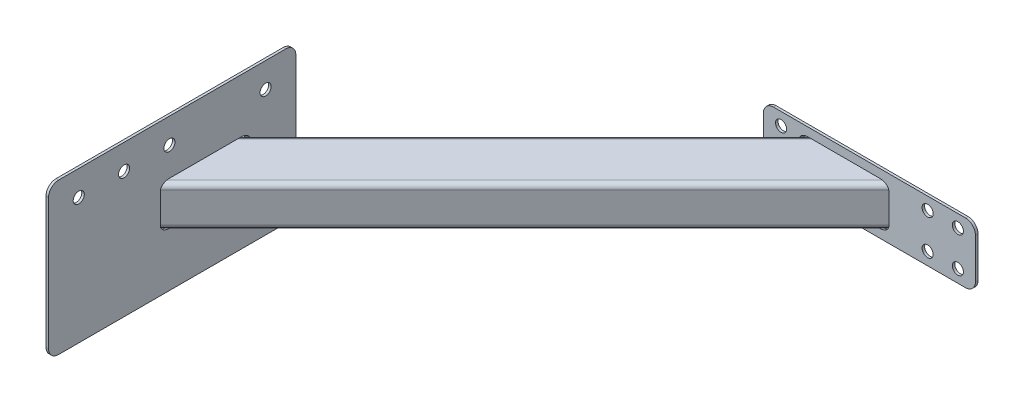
ISO-10303-21;
HEADER;
FILE_DESCRIPTION(('STEP AP214'),'2;1');
FILE_NAME('part.step','',(''),(''),'','','');
FILE_SCHEMA(('AUTOMOTIVE_DESIGN { 1 0 10303 214 1 1 1 1 }'));
ENDSEC;
DATA;
#1=APPLICATION_CONTEXT('core data for automotive mechanical design processes');
#2=APPLICATION_PROTOCOL_DEFINITION('international standard','automotive_design',2000,#1);
#3=PRODUCT_CONTEXT('',#1,'mechanical');
#4=PRODUCT('Part','Part','',(#3));
#5=PRODUCT_RELATED_PRODUCT_CATEGORY('part','',(#4));
#6=PRODUCT_DEFINITION_FORMATION('','',#4);
#7=PRODUCT_DEFINITION_CONTEXT('part definition',#1,'design');
#8=PRODUCT_DEFINITION('design','',#6,#7);
#9=PRODUCT_DEFINITION_SHAPE('','',#8);
#10=(LENGTH_UNIT() NAMED_UNIT(*) SI_UNIT(.MILLI.,.METRE.));
#11=(NAMED_UNIT(*) PLANE_ANGLE_UNIT() SI_UNIT($,.RADIAN.));
#12=(NAMED_UNIT(*) SI_UNIT($,.STERADIAN.) SOLID_ANGLE_UNIT());
#13=UNCERTAINTY_MEASURE_WITH_UNIT(LENGTH_MEASURE(1.E-05),#10,'distance_accuracy_value','');
#14=(GEOMETRIC_REPRESENTATION_CONTEXT(3) GLOBAL_UNCERTAINTY_ASSIGNED_CONTEXT((#13)) GLOBAL_UNIT_ASSIGNED_CONTEXT((#10,
#11,#12)) REPRESENTATION_CONTEXT('',''));
#15=CARTESIAN_POINT('',(0.,0.,0.));
#16=DIRECTION('',(0.,0.,1.));
#17=DIRECTION('',(1.,0.,0.));
#18=AXIS2_PLACEMENT_3D('',#15,#16,#17);
#19=CARTESIAN_POINT('',(8.89420183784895,-150.,-66.4169516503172));
#20=DIRECTION('',(1.,0.,0.));
#21=DIRECTION('',(0.,1.,0.));
#22=AXIS2_PLACEMENT_3D('',#19,#20,#21);
#23=PLANE('',#22);
#24=CARTESIAN_POINT('',(8.89420183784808,100.,-126.416951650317));
#25=DIRECTION('',(1.,0.,0.));
#26=DIRECTION('',(0.,1.,0.));
#27=AXIS2_PLACEMENT_3D('',#24,#25,#26);
#28=CIRCLE('',#27,10.9999999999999);
#29=CARTESIAN_POINT('',(8.89420183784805,111.,-126.416951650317));
#30=VERTEX_POINT('',#29);
#31=EDGE_CURVE('E331',#30,#30,#28,.T.);
#32=ORIENTED_EDGE('',*,*,#31,.T.);
#33=EDGE_LOOP('',(#32));
#34=FACE_BOUND('',#33,.T.);
#35=CARTESIAN_POINT('',(8.89420183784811,100.,-306.416951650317));
#36=DIRECTION('',(1.,0.,0.));
#37=DIRECTION('',(0.,1.,0.));
#38=AXIS2_PLACEMENT_3D('',#35,#36,#37);
#39=CIRCLE('',#38,10.9999999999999);
#40=CARTESIAN_POINT('',(8.89420183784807,111.,-306.416951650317));
#41=VERTEX_POINT('',#40);
#42=EDGE_CURVE('E634',#41,#41,#39,.T.);
#43=ORIENTED_EDGE('',*,*,#42,.T.);
#44=EDGE_LOOP('',(#43));
#45=FACE_BOUND('',#44,.T.);
#46=CARTESIAN_POINT('',(8.89420183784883,-100.,-497.335782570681));
#47=DIRECTION('',(1.,0.,0.));
#48=DIRECTION('',(0.,1.,0.));
#49=AXIS2_PLACEMENT_3D('',#46,#47,#48);
#50=CIRCLE('',#49,11.0000000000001);
#51=CARTESIAN_POINT('',(8.8942018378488,-88.9999999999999,-497.335782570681));
#52=VERTEX_POINT('',#51);
#53=EDGE_CURVE('E636',#52,#52,#50,.T.);
#54=ORIENTED_EDGE('',*,*,#53,.T.);
#55=EDGE_LOOP('',(#54));
#56=FACE_BOUND('',#55,.T.);
#57=CARTESIAN_POINT('',(8.89420183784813,100.,-497.335782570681));
#58=DIRECTION('',(1.,0.,0.));
#59=DIRECTION('',(0.,1.,0.));
#60=AXIS2_PLACEMENT_3D('',#57,#58,#59);
#61=CIRCLE('',#60,11.0000000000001);
#62=CARTESIAN_POINT('',(8.8942018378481,111.,-497.335782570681));
#63=VERTEX_POINT('',#62);
#64=EDGE_CURVE('E641',#63,#63,#61,.T.);
#65=ORIENTED_EDGE('',*,*,#64,.T.);
#66=EDGE_LOOP('',(#65));
#67=FACE_BOUND('',#66,.T.);
#68=CARTESIAN_POINT('',(8.8942018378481,100.,-216.416951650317));
#69=DIRECTION('',(1.,0.,0.));
#70=DIRECTION('',(0.,1.,0.));
#71=AXIS2_PLACEMENT_3D('',#68,#69,#70);
#72=CIRCLE('',#71,10.9999999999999);
#73=CARTESIAN_POINT('',(8.89420183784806,111.,-216.416951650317));
#74=VERTEX_POINT('',#73);
#75=EDGE_CURVE('E644',#74,#74,#72,.T.);
#76=ORIENTED_EDGE('',*,*,#75,.T.);
#77=EDGE_LOOP('',(#76));
#78=FACE_BOUND('',#77,.T.);
#79=CARTESIAN_POINT('',(8.89420183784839,30.0000000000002,-301.772290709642));
#80=DIRECTION('',(1.,0.,0.));
#81=DIRECTION('',(0.,0.,-1.));
#82=AXIS2_PLACEMENT_3D('',#79,#80,#81);
#83=ELLIPSE('',#82,18.3847763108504,13.0000000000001);
#84=CARTESIAN_POINT('',(8.89420183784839,30.0000000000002,-283.387514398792));
#85=VERTEX_POINT('',#84);
#86=CARTESIAN_POINT('',(8.89420183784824,43.0000000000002,-301.772290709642));
#87=VERTEX_POINT('',#86);
#88=EDGE_CURVE('E325',#85,#87,#83,.F.);
#89=ORIENTED_EDGE('',*,*,#88,.F.);
#90=DIRECTION('',(0.,1.,0.));
#91=VECTOR('',#90,1.);
#92=CARTESIAN_POINT('',(8.89420183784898,-150.,-283.387514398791));
#93=LINE('',#92,#91);
#94=CARTESIAN_POINT('',(8.89420183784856,-29.9999999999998,-283.387514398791));
#95=VERTEX_POINT('',#94);
#96=EDGE_CURVE('E287',#95,#85,#93,.T.);
#97=ORIENTED_EDGE('',*,*,#96,.F.);
#98=CARTESIAN_POINT('',(8.8942018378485,-29.9999999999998,-301.772290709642));
#99=DIRECTION('',(1.,0.,0.));
#100=DIRECTION('',(0.,0.,-1.));
#101=AXIS2_PLACEMENT_3D('',#98,#99,#100);
#102=ELLIPSE('',#101,18.3847763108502,13.);
#103=CARTESIAN_POINT('',(8.8942018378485,-42.9999999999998,-301.772290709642));
#104=VERTEX_POINT('',#103);
#105=EDGE_CURVE('E279',#104,#95,#102,.F.);
#106=ORIENTED_EDGE('',*,*,#105,.F.);
#107=DIRECTION('',(0.,0.,1.));
#108=VECTOR('',#107,1.);
#109=CARTESIAN_POINT('',(8.89420183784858,-42.9999999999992,-66.4169516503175));
#110=LINE('',#109,#108);
#111=CARTESIAN_POINT('',(8.89420183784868,-43.0000000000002,-443.193646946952));
#112=VERTEX_POINT('',#111);
#113=EDGE_CURVE('E296',#112,#104,#110,.T.);
#114=ORIENTED_EDGE('',*,*,#113,.F.);
#115=CARTESIAN_POINT('',(8.8942018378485,-30.0000000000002,-443.193646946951));
#116=DIRECTION('',(1.,0.,0.));
#117=DIRECTION('',(0.,0.,-1.));
#118=AXIS2_PLACEMENT_3D('',#115,#116,#117);
#119=ELLIPSE('',#118,18.3847763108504,13.0000000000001);
#120=CARTESIAN_POINT('',(8.8942018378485,-30.0000000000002,-461.578423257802));
#121=VERTEX_POINT('',#120);
#122=EDGE_CURVE('E300',#121,#112,#119,.F.);
#123=ORIENTED_EDGE('',*,*,#122,.F.);
#124=DIRECTION('',(0.,-1.,0.));
#125=VECTOR('',#124,1.);
#126=CARTESIAN_POINT('',(8.89420183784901,-150.000000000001,-461.578423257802));
#127=LINE('',#126,#125);
#128=CARTESIAN_POINT('',(8.8942018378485,29.9999999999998,-461.578423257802));
#129=VERTEX_POINT('',#128);
#130=EDGE_CURVE('E304',#129,#121,#127,.T.);
#131=ORIENTED_EDGE('',*,*,#130,.F.);
#132=CARTESIAN_POINT('',(8.89420183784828,29.9999999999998,-443.193646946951));
#133=DIRECTION('',(1.,0.,0.));
#134=DIRECTION('',(0.,0.,-1.));
#135=AXIS2_PLACEMENT_3D('',#132,#133,#134);
#136=ELLIPSE('',#135,18.3847763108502,12.9999999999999);
#137=CARTESIAN_POINT('',(8.89420183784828,42.9999999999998,-443.193646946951));
#138=VERTEX_POINT('',#137);
#139=EDGE_CURVE('E308',#138,#129,#136,.F.);
#140=ORIENTED_EDGE('',*,*,#139,.F.);
#141=DIRECTION('',(0.,0.,-1.));
#142=VECTOR('',#141,1.);
#143=CARTESIAN_POINT('',(8.89420183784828,43.0000000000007,-66.4169516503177));
#144=LINE('',#143,#142);
#145=EDGE_CURVE('E312',#87,#138,#144,.T.);
#146=ORIENTED_EDGE('',*,*,#145,.F.);
#147=EDGE_LOOP('',(#89,#97,#106,#114,#123,#131,#140,#146));
#148=FACE_BOUND('',#147,.T.);
#149=DIRECTION('',(0.,0.,-1.));
#150=VECTOR('',#149,1.);
#151=CARTESIAN_POINT('',(8.89420183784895,-150.,-66.4169516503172));
#152=LINE('',#151,#150);
#153=CARTESIAN_POINT('',(8.89420183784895,-150.,-86.4169516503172));
#154=VERTEX_POINT('',#153);
#155=CARTESIAN_POINT('',(8.89420183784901,-150.,-537.335782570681));
#156=VERTEX_POINT('',#155);
#157=EDGE_CURVE('E322',#154,#156,#152,.T.);
#158=ORIENTED_EDGE('',*,*,#157,.F.);
#159=CARTESIAN_POINT('',(8.89420183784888,-130.,-86.4169516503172));
#160=DIRECTION('',(1.,0.,0.));
#161=DIRECTION('',(0.,1.,0.));
#162=AXIS2_PLACEMENT_3D('',#159,#160,#161);
#163=CIRCLE('',#162,20.);
#164=CARTESIAN_POINT('',(8.89420183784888,-130.,-66.4169516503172));
#165=VERTEX_POINT('',#164);
#166=EDGE_CURVE('E357',#154,#165,#163,.F.);
#167=ORIENTED_EDGE('',*,*,#166,.T.);
#168=DIRECTION('',(0.,-1.,0.));
#169=VECTOR('',#168,1.);
#170=CARTESIAN_POINT('',(8.89420183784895,-150.,-66.4169516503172));
#171=LINE('',#170,#169);
#172=CARTESIAN_POINT('',(8.89420183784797,130.,-66.4169516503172));
#173=VERTEX_POINT('',#172);
#174=EDGE_CURVE('E271',#173,#165,#171,.T.);
#175=ORIENTED_EDGE('',*,*,#174,.F.);
#176=CARTESIAN_POINT('',(8.89420183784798,130.,-86.4169516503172));
#177=DIRECTION('',(1.,0.,0.));
#178=DIRECTION('',(0.,1.,0.));
#179=AXIS2_PLACEMENT_3D('',#176,#177,#178);
#180=CIRCLE('',#179,20.);
#181=CARTESIAN_POINT('',(8.89420183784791,150.,-86.4169516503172));
#182=VERTEX_POINT('',#181);
#183=EDGE_CURVE('E355',#173,#182,#180,.F.);
#184=ORIENTED_EDGE('',*,*,#183,.T.);
#185=DIRECTION('',(0.,0.,-1.));
#186=VECTOR('',#185,1.);
#187=CARTESIAN_POINT('',(8.8942018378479,150.,-66.4169516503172));
#188=LINE('',#187,#186);
#189=CARTESIAN_POINT('',(8.89420183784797,150.,-537.335782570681));
#190=VERTEX_POINT('',#189);
#191=EDGE_CURVE('E317',#182,#190,#188,.T.);
#192=ORIENTED_EDGE('',*,*,#191,.T.);
#193=CARTESIAN_POINT('',(8.89420183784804,130.,-537.335782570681));
#194=DIRECTION('',(1.,0.,0.));
#195=DIRECTION('',(0.,1.,0.));
#196=AXIS2_PLACEMENT_3D('',#193,#194,#195);
#197=CIRCLE('',#196,20.);
#198=CARTESIAN_POINT('',(8.89420183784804,130.,-557.335782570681));
#199=VERTEX_POINT('',#198);
#200=EDGE_CURVE('E169',#190,#199,#197,.F.);
#201=ORIENTED_EDGE('',*,*,#200,.T.);
#202=DIRECTION('',(0.,-1.,0.));
#203=VECTOR('',#202,1.);
#204=CARTESIAN_POINT('',(8.89420183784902,-150.,-557.335782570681));
#205=LINE('',#204,#203);
#206=CARTESIAN_POINT('',(8.89420183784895,-130.,-557.335782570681));
#207=VERTEX_POINT('',#206);
#208=EDGE_CURVE('E314',#199,#207,#205,.T.);
#209=ORIENTED_EDGE('',*,*,#208,.T.);
#210=CARTESIAN_POINT('',(8.89420183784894,-130.,-537.335782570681));
#211=DIRECTION('',(1.,0.,0.));
#212=DIRECTION('',(0.,1.,0.));
#213=AXIS2_PLACEMENT_3D('',#210,#211,#212);
#214=CIRCLE('',#213,20.);
#215=EDGE_CURVE('E353',#207,#156,#214,.F.);
#216=ORIENTED_EDGE('',*,*,#215,.T.);
#217=EDGE_LOOP('',(#158,#167,#175,#184,#192,#201,#209,#216));
#218=FACE_BOUND('',#217,.T.);
#219=ADVANCED_FACE('F149',(#34,#45,#56,#67,#78,#148,#218),#23,.F.);
#220=CARTESIAN_POINT('',(13.894201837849,-150.,-66.4169516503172));
#221=DIRECTION('',(-1.,0.,0.));
#222=DIRECTION('',(0.,-1.,0.));
#223=AXIS2_PLACEMENT_3D('',#220,#221,#222);
#224=PLANE('',#223);
#225=CARTESIAN_POINT('',(13.8942018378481,100.,-126.416951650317));
#226=DIRECTION('',(1.,0.,0.));
#227=DIRECTION('',(0.,1.,0.));
#228=AXIS2_PLACEMENT_3D('',#225,#226,#227);
#229=CIRCLE('',#228,10.9999999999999);
#230=CARTESIAN_POINT('',(13.894201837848,111.,-126.416951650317));
#231=VERTEX_POINT('',#230);
#232=EDGE_CURVE('E632',#231,#231,#229,.T.);
#233=ORIENTED_EDGE('',*,*,#232,.F.);
#234=EDGE_LOOP('',(#233));
#235=FACE_BOUND('',#234,.T.);
#236=CARTESIAN_POINT('',(13.894201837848,100.,-306.416951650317));
#237=DIRECTION('',(1.,0.,0.));
#238=DIRECTION('',(0.,1.,0.));
#239=AXIS2_PLACEMENT_3D('',#236,#237,#238);
#240=CIRCLE('',#239,10.9999999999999);
#241=CARTESIAN_POINT('',(13.894201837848,111.,-306.416951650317));
#242=VERTEX_POINT('',#241);
#243=EDGE_CURVE('E650',#242,#242,#240,.T.);
#244=ORIENTED_EDGE('',*,*,#243,.F.);
#245=EDGE_LOOP('',(#244));
#246=FACE_BOUND('',#245,.T.);
#247=CARTESIAN_POINT('',(13.8942018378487,-100.,-497.335782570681));
#248=DIRECTION('',(1.,0.,0.));
#249=DIRECTION('',(0.,1.,0.));
#250=AXIS2_PLACEMENT_3D('',#247,#248,#249);
#251=CIRCLE('',#250,11.0000000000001);
#252=CARTESIAN_POINT('',(13.8942018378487,-88.9999999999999,-497.335782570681));
#253=VERTEX_POINT('',#252);
#254=EDGE_CURVE('E657',#253,#253,#251,.T.);
#255=ORIENTED_EDGE('',*,*,#254,.F.);
#256=EDGE_LOOP('',(#255));
#257=FACE_BOUND('',#256,.T.);
#258=CARTESIAN_POINT('',(13.894201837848,100.,-497.335782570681));
#259=DIRECTION('',(1.,0.,0.));
#260=DIRECTION('',(0.,1.,0.));
#261=AXIS2_PLACEMENT_3D('',#258,#259,#260);
#262=CIRCLE('',#261,11.0000000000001);
#263=CARTESIAN_POINT('',(13.894201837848,111.,-497.335782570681));
#264=VERTEX_POINT('',#263);
#265=EDGE_CURVE('E653',#264,#264,#262,.T.);
#266=ORIENTED_EDGE('',*,*,#265,.F.);
#267=EDGE_LOOP('',(#266));
#268=FACE_BOUND('',#267,.T.);
#269=CARTESIAN_POINT('',(13.894201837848,100.,-216.416951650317));
#270=DIRECTION('',(1.,0.,0.));
#271=DIRECTION('',(0.,1.,0.));
#272=AXIS2_PLACEMENT_3D('',#269,#270,#271);
#273=CIRCLE('',#272,10.9999999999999);
#274=CARTESIAN_POINT('',(13.894201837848,111.,-216.416951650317));
#275=VERTEX_POINT('',#274);
#276=EDGE_CURVE('E647',#275,#275,#273,.T.);
#277=ORIENTED_EDGE('',*,*,#276,.F.);
#278=EDGE_LOOP('',(#277));
#279=FACE_BOUND('',#278,.T.);
#280=CARTESIAN_POINT('',(13.8942018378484,30.0000000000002,-306.772290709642));
#281=DIRECTION('',(-1.,0.,0.));
#282=DIRECTION('',(0.,0.,-1.));
#283=AXIS2_PLACEMENT_3D('',#280,#281,#282);
#284=ELLIPSE('',#283,18.3847763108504,13.0000000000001);
#285=CARTESIAN_POINT('',(13.8942018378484,43.0000000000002,-306.772290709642));
#286=VERTEX_POINT('',#285);
#287=CARTESIAN_POINT('',(13.8942018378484,30.0000000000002,-288.387514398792));
#288=VERTEX_POINT('',#287);
#289=EDGE_CURVE('E310',#286,#288,#284,.F.);
#290=ORIENTED_EDGE('',*,*,#289,.F.);
#291=DIRECTION('',(0.,0.,1.));
#292=VECTOR('',#291,1.);
#293=CARTESIAN_POINT('',(13.8942018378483,43.0000000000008,-66.4169516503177));
#294=LINE('',#293,#292);
#295=CARTESIAN_POINT('',(13.8942018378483,42.9999999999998,-448.193646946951));
#296=VERTEX_POINT('',#295);
#297=EDGE_CURVE('E306',#296,#286,#294,.T.);
#298=ORIENTED_EDGE('',*,*,#297,.F.);
#299=CARTESIAN_POINT('',(13.8942018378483,29.9999999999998,-448.193646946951));
#300=DIRECTION('',(-1.,0.,0.));
#301=DIRECTION('',(0.,0.,-1.));
#302=AXIS2_PLACEMENT_3D('',#299,#300,#301);
#303=ELLIPSE('',#302,18.3847763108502,12.9999999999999);
#304=CARTESIAN_POINT('',(13.8942018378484,29.9999999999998,-466.578423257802));
#305=VERTEX_POINT('',#304);
#306=EDGE_CURVE('E302',#305,#296,#303,.F.);
#307=ORIENTED_EDGE('',*,*,#306,.F.);
#308=DIRECTION('',(0.,1.,0.));
#309=VECTOR('',#308,1.);
#310=CARTESIAN_POINT('',(13.894201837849,-150.000000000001,-466.578423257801));
#311=LINE('',#310,#309);
#312=CARTESIAN_POINT('',(13.8942018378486,-30.0000000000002,-466.578423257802));
#313=VERTEX_POINT('',#312);
#314=EDGE_CURVE('E298',#313,#305,#311,.T.);
#315=ORIENTED_EDGE('',*,*,#314,.F.);
#316=CARTESIAN_POINT('',(13.8942018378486,-30.0000000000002,-448.193646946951));
#317=DIRECTION('',(-1.,0.,0.));
#318=DIRECTION('',(0.,0.,-1.));
#319=AXIS2_PLACEMENT_3D('',#316,#317,#318);
#320=ELLIPSE('',#319,18.3847763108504,13.0000000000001);
#321=CARTESIAN_POINT('',(13.8942018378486,-43.0000000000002,-448.193646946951));
#322=VERTEX_POINT('',#321);
#323=EDGE_CURVE('E294',#322,#313,#320,.F.);
#324=ORIENTED_EDGE('',*,*,#323,.F.);
#325=DIRECTION('',(0.,0.,-1.));
#326=VECTOR('',#325,1.);
#327=CARTESIAN_POINT('',(13.8942018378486,-42.9999999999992,-66.4169516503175));
#328=LINE('',#327,#326);
#329=CARTESIAN_POINT('',(13.8942018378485,-42.9999999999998,-306.772290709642));
#330=VERTEX_POINT('',#329);
#331=EDGE_CURVE('E286',#330,#322,#328,.T.);
#332=ORIENTED_EDGE('',*,*,#331,.F.);
#333=CARTESIAN_POINT('',(13.8942018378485,-29.9999999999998,-306.772290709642));
#334=DIRECTION('',(-1.,0.,0.));
#335=DIRECTION('',(0.,0.,-1.));
#336=AXIS2_PLACEMENT_3D('',#333,#334,#335);
#337=ELLIPSE('',#336,18.3847763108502,13.);
#338=CARTESIAN_POINT('',(13.8942018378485,-29.9999999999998,-288.387514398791));
#339=VERTEX_POINT('',#338);
#340=EDGE_CURVE('E276',#339,#330,#337,.F.);
#341=ORIENTED_EDGE('',*,*,#340,.F.);
#342=DIRECTION('',(0.,-1.,0.));
#343=VECTOR('',#342,1.);
#344=CARTESIAN_POINT('',(13.894201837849,-150.,-288.387514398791));
#345=LINE('',#344,#343);
#346=EDGE_CURVE('E260',#288,#339,#345,.T.);
#347=ORIENTED_EDGE('',*,*,#346,.F.);
#348=EDGE_LOOP('',(#290,#298,#307,#315,#324,#332,#341,#347));
#349=FACE_BOUND('',#348,.T.);
#350=DIRECTION('',(0.,1.,0.));
#351=VECTOR('',#350,1.);
#352=CARTESIAN_POINT('',(13.894201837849,-150.,-66.4169516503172));
#353=LINE('',#352,#351);
#354=CARTESIAN_POINT('',(13.8942018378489,-130.,-66.4169516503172));
#355=VERTEX_POINT('',#354);
#356=CARTESIAN_POINT('',(13.894201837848,130.,-66.4169516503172));
#357=VERTEX_POINT('',#356);
#358=EDGE_CURVE('E336',#355,#357,#353,.T.);
#359=ORIENTED_EDGE('',*,*,#358,.F.);
#360=CARTESIAN_POINT('',(13.8942018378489,-130.,-86.4169516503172));
#361=DIRECTION('',(-1.,0.,0.));
#362=DIRECTION('',(0.,-1.,0.));
#363=AXIS2_PLACEMENT_3D('',#360,#361,#362);
#364=CIRCLE('',#363,20.);
#365=CARTESIAN_POINT('',(13.894201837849,-150.,-86.4169516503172));
#366=VERTEX_POINT('',#365);
#367=EDGE_CURVE('E345',#355,#366,#364,.F.);
#368=ORIENTED_EDGE('',*,*,#367,.T.);
#369=DIRECTION('',(0.,0.,-1.));
#370=VECTOR('',#369,1.);
#371=CARTESIAN_POINT('',(13.894201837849,-150.,-66.4169516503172));
#372=LINE('',#371,#370);
#373=CARTESIAN_POINT('',(13.894201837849,-150.,-537.335782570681));
#374=VERTEX_POINT('',#373);
#375=EDGE_CURVE('E316',#366,#374,#372,.T.);
#376=ORIENTED_EDGE('',*,*,#375,.T.);
#377=CARTESIAN_POINT('',(13.8942018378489,-130.,-537.335782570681));
#378=DIRECTION('',(-1.,0.,0.));
#379=DIRECTION('',(0.,-1.,0.));
#380=AXIS2_PLACEMENT_3D('',#377,#378,#379);
#381=CIRCLE('',#380,20.);
#382=CARTESIAN_POINT('',(13.8942018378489,-130.,-557.335782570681));
#383=VERTEX_POINT('',#382);
#384=EDGE_CURVE('E341',#374,#383,#381,.F.);
#385=ORIENTED_EDGE('',*,*,#384,.T.);
#386=DIRECTION('',(0.,1.,0.));
#387=VECTOR('',#386,1.);
#388=CARTESIAN_POINT('',(13.894201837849,-150.,-557.335782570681));
#389=LINE('',#388,#387);
#390=CARTESIAN_POINT('',(13.894201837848,130.,-557.335782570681));
#391=VERTEX_POINT('',#390);
#392=EDGE_CURVE('E318',#383,#391,#389,.T.);
#393=ORIENTED_EDGE('',*,*,#392,.T.);
#394=CARTESIAN_POINT('',(13.894201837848,130.,-537.335782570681));
#395=DIRECTION('',(-1.,0.,0.));
#396=DIRECTION('',(0.,-1.,0.));
#397=AXIS2_PLACEMENT_3D('',#394,#395,#396);
#398=CIRCLE('',#397,20.);
#399=CARTESIAN_POINT('',(13.894201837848,150.,-537.335782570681));
#400=VERTEX_POINT('',#399);
#401=EDGE_CURVE('E339',#391,#400,#398,.F.);
#402=ORIENTED_EDGE('',*,*,#401,.T.);
#403=DIRECTION('',(0.,0.,-1.));
#404=VECTOR('',#403,1.);
#405=CARTESIAN_POINT('',(13.8942018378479,150.,-66.4169516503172));
#406=LINE('',#405,#404);
#407=CARTESIAN_POINT('',(13.8942018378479,150.,-86.4169516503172));
#408=VERTEX_POINT('',#407);
#409=EDGE_CURVE('E321',#408,#400,#406,.T.);
#410=ORIENTED_EDGE('',*,*,#409,.F.);
#411=CARTESIAN_POINT('',(13.894201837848,130.,-86.4169516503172));
#412=DIRECTION('',(-1.,0.,0.));
#413=DIRECTION('',(0.,-1.,0.));
#414=AXIS2_PLACEMENT_3D('',#411,#412,#413);
#415=CIRCLE('',#414,20.);
#416=EDGE_CURVE('E343',#408,#357,#415,.F.);
#417=ORIENTED_EDGE('',*,*,#416,.T.);
#418=EDGE_LOOP('',(#359,#368,#376,#385,#393,#402,#410,#417));
#419=FACE_BOUND('',#418,.T.);
#420=ADVANCED_FACE('F283',(#235,#246,#257,#268,#279,#349,#419),#224,.F.);
#421=CARTESIAN_POINT('',(8.8942018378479,150.,-66.4169516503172));
#422=DIRECTION('',(0.,-1.,0.));
#423=DIRECTION('',(0.,0.,-1.));
#424=AXIS2_PLACEMENT_3D('',#421,#422,#423);
#425=PLANE('',#424);
#426=ORIENTED_EDGE('',*,*,#191,.F.);
#427=DIRECTION('',(-1.,0.,0.));
#428=VECTOR('',#427,1.);
#429=CARTESIAN_POINT('',(13.8942018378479,150.,-86.4169516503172));
#430=LINE('',#429,#428);
#431=EDGE_CURVE('E362',#182,#408,#430,.F.);
#432=ORIENTED_EDGE('',*,*,#431,.T.);
#433=ORIENTED_EDGE('',*,*,#409,.T.);
#434=DIRECTION('',(-1.,0.,0.));
#435=VECTOR('',#434,1.);
#436=CARTESIAN_POINT('',(8.8942018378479,150.,-537.335782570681));
#437=LINE('',#436,#435);
#438=EDGE_CURVE('E359',#400,#190,#437,.T.);
#439=ORIENTED_EDGE('',*,*,#438,.T.);
#440=EDGE_LOOP('',(#426,#432,#433,#439));
#441=FACE_BOUND('',#440,.T.);
#442=ADVANCED_FACE('F372',(#441),#425,.F.);
#443=CARTESIAN_POINT('',(8.89420183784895,-150.,-66.4169516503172));
#444=DIRECTION('',(0.,1.,0.));
#445=DIRECTION('',(0.,0.,1.));
#446=AXIS2_PLACEMENT_3D('',#443,#444,#445);
#447=PLANE('',#446);
#448=ORIENTED_EDGE('',*,*,#375,.F.);
#449=DIRECTION('',(1.,0.,0.));
#450=VECTOR('',#449,1.);
#451=CARTESIAN_POINT('',(8.89420183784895,-150.,-86.4169516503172));
#452=LINE('',#451,#450);
#453=EDGE_CURVE('E350',#366,#154,#452,.F.);
#454=ORIENTED_EDGE('',*,*,#453,.T.);
#455=ORIENTED_EDGE('',*,*,#157,.T.);
#456=DIRECTION('',(1.,0.,0.));
#457=VECTOR('',#456,1.);
#458=CARTESIAN_POINT('',(8.89420183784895,-150.,-537.335782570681));
#459=LINE('',#458,#457);
#460=EDGE_CURVE('E347',#156,#374,#459,.T.);
#461=ORIENTED_EDGE('',*,*,#460,.T.);
#462=EDGE_LOOP('',(#448,#454,#455,#461));
#463=FACE_BOUND('',#462,.T.);
#464=ADVANCED_FACE('F472',(#463),#447,.F.);
#465=CARTESIAN_POINT('',(-735.829489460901,30.0000000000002,442.951400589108));
#466=DIRECTION('',(0.707106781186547,0.,-0.707106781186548));
#467=DIRECTION('',(-0.707106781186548,0.,-0.707106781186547));
#468=AXIS2_PLACEMENT_3D('',#465,#466,#467);
#469=CYLINDRICAL_SURFACE('',#468,13.0000000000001);
#470=ORIENTED_EDGE('',*,*,#88,.T.);
#471=DIRECTION('',(0.707106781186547,0.,-0.707106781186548));
#472=VECTOR('',#471,1.);
#473=CARTESIAN_POINT('',(-735.829489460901,43.0000000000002,442.951400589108));
#474=LINE('',#473,#472);
#475=EDGE_CURVE('E313',#87,#286,#474,.T.);
#476=ORIENTED_EDGE('',*,*,#475,.T.);
#477=ORIENTED_EDGE('',*,*,#289,.T.);
#478=DIRECTION('',(0.707106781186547,0.,-0.707106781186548));
#479=VECTOR('',#478,1.);
#480=CARTESIAN_POINT('',(-726.637101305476,30.0000000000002,452.143788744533));
#481=LINE('',#480,#479);
#482=EDGE_CURVE('E266',#85,#288,#481,.T.);
#483=ORIENTED_EDGE('',*,*,#482,.F.);
#484=EDGE_LOOP('',(#470,#476,#477,#483));
#485=FACE_BOUND('',#484,.T.);
#486=ADVANCED_FACE('F409',(#485),#469,.F.);
#487=CARTESIAN_POINT('',(-806.540167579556,42.9999999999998,372.240722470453));
#488=DIRECTION('',(0.,-1.,0.));
#489=DIRECTION('',(1.,0.,0.));
#490=AXIS2_PLACEMENT_3D('',#487,#488,#489);
#491=PLANE('',#490);
#492=ORIENTED_EDGE('',*,*,#145,.T.);
#493=DIRECTION('',(0.707106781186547,0.,-0.707106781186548));
#494=VECTOR('',#493,1.);
#495=CARTESIAN_POINT('',(-806.540167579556,42.9999999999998,372.240722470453));
#496=LINE('',#495,#494);
#497=EDGE_CURVE('E309',#138,#296,#496,.T.);
#498=ORIENTED_EDGE('',*,*,#497,.T.);
#499=ORIENTED_EDGE('',*,*,#297,.T.);
#500=ORIENTED_EDGE('',*,*,#475,.F.);
#501=EDGE_LOOP('',(#492,#498,#499,#500));
#502=FACE_BOUND('',#501,.T.);
#503=ADVANCED_FACE('F413',(#502),#491,.T.);
#504=CARTESIAN_POINT('',(-806.540167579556,29.9999999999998,372.240722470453));
#505=DIRECTION('',(0.707106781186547,0.,-0.707106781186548));
#506=DIRECTION('',(-0.707106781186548,0.,-0.707106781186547));
#507=AXIS2_PLACEMENT_3D('',#504,#505,#506);
#508=CYLINDRICAL_SURFACE('',#507,12.9999999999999);
#509=ORIENTED_EDGE('',*,*,#139,.T.);
#510=DIRECTION('',(0.707106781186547,0.,-0.707106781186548));
#511=VECTOR('',#510,1.);
#512=CARTESIAN_POINT('',(-815.732555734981,29.9999999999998,363.048334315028));
#513=LINE('',#512,#511);
#514=EDGE_CURVE('E305',#129,#305,#513,.T.);
#515=ORIENTED_EDGE('',*,*,#514,.T.);
#516=ORIENTED_EDGE('',*,*,#306,.T.);
#517=ORIENTED_EDGE('',*,*,#497,.F.);
#518=EDGE_LOOP('',(#509,#515,#516,#517));
#519=FACE_BOUND('',#518,.T.);
#520=ADVANCED_FACE('F421',(#519),#508,.F.);
#521=CARTESIAN_POINT('',(-815.732555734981,29.9999999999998,363.048334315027));
#522=DIRECTION('',(0.707106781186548,0.,0.707106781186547));
#523=DIRECTION('',(0.707106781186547,0.,-0.707106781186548));
#524=AXIS2_PLACEMENT_3D('',#521,#522,#523);
#525=PLANE('',#524);
#526=ORIENTED_EDGE('',*,*,#130,.T.);
#527=DIRECTION('',(0.707106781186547,0.,-0.707106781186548));
#528=VECTOR('',#527,1.);
#529=CARTESIAN_POINT('',(-815.732555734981,-30.0000000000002,363.048334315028));
#530=LINE('',#529,#528);
#531=EDGE_CURVE('E301',#121,#313,#530,.T.);
#532=ORIENTED_EDGE('',*,*,#531,.T.);
#533=ORIENTED_EDGE('',*,*,#314,.T.);
#534=ORIENTED_EDGE('',*,*,#514,.F.);
#535=EDGE_LOOP('',(#526,#532,#533,#534));
#536=FACE_BOUND('',#535,.T.);
#537=ADVANCED_FACE('F424',(#536),#525,.T.);
#538=CARTESIAN_POINT('',(-806.540167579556,-30.0000000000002,372.240722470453));
#539=DIRECTION('',(0.707106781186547,0.,-0.707106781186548));
#540=DIRECTION('',(-0.707106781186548,0.,-0.707106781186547));
#541=AXIS2_PLACEMENT_3D('',#538,#539,#540);
#542=CYLINDRICAL_SURFACE('',#541,13.0000000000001);
#543=ORIENTED_EDGE('',*,*,#122,.T.);
#544=DIRECTION('',(0.707106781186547,0.,-0.707106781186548));
#545=VECTOR('',#544,1.);
#546=CARTESIAN_POINT('',(-806.540167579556,-43.0000000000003,372.240722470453));
#547=LINE('',#546,#545);
#548=EDGE_CURVE('E297',#112,#322,#547,.T.);
#549=ORIENTED_EDGE('',*,*,#548,.T.);
#550=ORIENTED_EDGE('',*,*,#323,.T.);
#551=ORIENTED_EDGE('',*,*,#531,.F.);
#552=EDGE_LOOP('',(#543,#549,#550,#551));
#553=FACE_BOUND('',#552,.T.);
#554=ADVANCED_FACE('F428',(#553),#542,.F.);
#555=CARTESIAN_POINT('',(-735.829489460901,-42.9999999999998,442.951400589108));
#556=DIRECTION('',(0.,1.,0.));
#557=DIRECTION('',(-1.,0.,0.));
#558=AXIS2_PLACEMENT_3D('',#555,#556,#557);
#559=PLANE('',#558);
#560=ORIENTED_EDGE('',*,*,#113,.T.);
#561=DIRECTION('',(0.707106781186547,0.,-0.707106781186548));
#562=VECTOR('',#561,1.);
#563=CARTESIAN_POINT('',(-735.829489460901,-42.9999999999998,442.951400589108));
#564=LINE('',#563,#562);
#565=EDGE_CURVE('E293',#104,#330,#564,.T.);
#566=ORIENTED_EDGE('',*,*,#565,.T.);
#567=ORIENTED_EDGE('',*,*,#331,.T.);
#568=ORIENTED_EDGE('',*,*,#548,.F.);
#569=EDGE_LOOP('',(#560,#566,#567,#568));
#570=FACE_BOUND('',#569,.T.);
#571=ADVANCED_FACE('F432',(#570),#559,.T.);
#572=CARTESIAN_POINT('',(-735.829489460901,-29.9999999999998,442.951400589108));
#573=DIRECTION('',(0.707106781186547,0.,-0.707106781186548));
#574=DIRECTION('',(-0.707106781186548,0.,-0.707106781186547));
#575=AXIS2_PLACEMENT_3D('',#572,#573,#574);
#576=CYLINDRICAL_SURFACE('',#575,13.);
#577=ORIENTED_EDGE('',*,*,#105,.T.);
#578=DIRECTION('',(0.707106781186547,0.,-0.707106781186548));
#579=VECTOR('',#578,1.);
#580=CARTESIAN_POINT('',(-726.637101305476,-29.9999999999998,452.143788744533));
#581=LINE('',#580,#579);
#582=EDGE_CURVE('E263',#95,#339,#581,.T.);
#583=ORIENTED_EDGE('',*,*,#582,.T.);
#584=ORIENTED_EDGE('',*,*,#340,.T.);
#585=ORIENTED_EDGE('',*,*,#565,.F.);
#586=EDGE_LOOP('',(#577,#583,#584,#585));
#587=FACE_BOUND('',#586,.T.);
#588=ADVANCED_FACE('F274',(#587),#576,.F.);
#589=CARTESIAN_POINT('',(-726.637101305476,-29.9999999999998,452.143788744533));
#590=DIRECTION('',(-0.707106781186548,0.,-0.707106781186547));
#591=DIRECTION('',(-0.707106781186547,0.,0.707106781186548));
#592=AXIS2_PLACEMENT_3D('',#589,#590,#591);
#593=PLANE('',#592);
#594=ORIENTED_EDGE('',*,*,#96,.T.);
#595=ORIENTED_EDGE('',*,*,#482,.T.);
#596=ORIENTED_EDGE('',*,*,#346,.T.);
#597=ORIENTED_EDGE('',*,*,#582,.F.);
#598=EDGE_LOOP('',(#594,#595,#596,#597));
#599=FACE_BOUND('',#598,.T.);
#600=ADVANCED_FACE('F262',(#599),#593,.T.);
#601=CARTESIAN_POINT('',(0.,0.,-66.4169516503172));
#602=DIRECTION('',(0.,0.,1.));
#603=DIRECTION('',(1.,0.,0.));
#604=AXIS2_PLACEMENT_3D('',#601,#602,#603);
#605=PLANE('',#604);
#606=ORIENTED_EDGE('',*,*,#174,.T.);
#607=DIRECTION('',(1.,0.,0.));
#608=VECTOR('',#607,1.);
#609=CARTESIAN_POINT('',(13.894201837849,-130.,-66.4169516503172));
#610=LINE('',#609,#608);
#611=EDGE_CURVE('E335',#165,#355,#610,.T.);
#612=ORIENTED_EDGE('',*,*,#611,.T.);
#613=ORIENTED_EDGE('',*,*,#358,.T.);
#614=DIRECTION('',(-1.,0.,0.));
#615=VECTOR('',#614,1.);
#616=CARTESIAN_POINT('',(8.8942018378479,130.,-66.4169516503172));
#617=LINE('',#616,#615);
#618=EDGE_CURVE('E332',#357,#173,#617,.T.);
#619=ORIENTED_EDGE('',*,*,#618,.T.);
#620=EDGE_LOOP('',(#606,#612,#613,#619));
#621=FACE_BOUND('',#620,.T.);
#622=ADVANCED_FACE('F383',(#621),#605,.T.);
#623=CARTESIAN_POINT('',(0.,0.,-557.335782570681));
#624=DIRECTION('',(0.,0.,1.));
#625=DIRECTION('',(1.,0.,0.));
#626=AXIS2_PLACEMENT_3D('',#623,#624,#625);
#627=PLANE('',#626);
#628=ORIENTED_EDGE('',*,*,#392,.F.);
#629=DIRECTION('',(1.,0.,0.));
#630=VECTOR('',#629,1.);
#631=CARTESIAN_POINT('',(0.,-130.,-557.335782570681));
#632=LINE('',#631,#630);
#633=EDGE_CURVE('E14',#383,#207,#632,.F.);
#634=ORIENTED_EDGE('',*,*,#633,.T.);
#635=ORIENTED_EDGE('',*,*,#208,.F.);
#636=DIRECTION('',(-1.,0.,0.));
#637=VECTOR('',#636,1.);
#638=CARTESIAN_POINT('',(0.,130.,-557.335782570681));
#639=LINE('',#638,#637);
#640=EDGE_CURVE('E157',#199,#391,#639,.F.);
#641=ORIENTED_EDGE('',*,*,#640,.T.);
#642=EDGE_LOOP('',(#628,#634,#635,#641));
#643=FACE_BOUND('',#642,.T.);
#644=ADVANCED_FACE('F364',(#643),#627,.F.);
#645=CARTESIAN_POINT('',(0.,-130.,-86.4169516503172));
#646=DIRECTION('',(-1.,0.,0.));
#647=DIRECTION('',(0.,0.,1.));
#648=AXIS2_PLACEMENT_3D('',#645,#646,#647);
#649=CYLINDRICAL_SURFACE('',#648,20.);
#650=ORIENTED_EDGE('',*,*,#166,.F.);
#651=ORIENTED_EDGE('',*,*,#453,.F.);
#652=ORIENTED_EDGE('',*,*,#367,.F.);
#653=ORIENTED_EDGE('',*,*,#611,.F.);
#654=EDGE_LOOP('',(#650,#651,#652,#653));
#655=FACE_BOUND('',#654,.T.);
#656=ADVANCED_FACE('F455',(#655),#649,.T.);
#657=CARTESIAN_POINT('',(0.,130.,-86.4169516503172));
#658=DIRECTION('',(1.,0.,0.));
#659=DIRECTION('',(0.,0.,-1.));
#660=AXIS2_PLACEMENT_3D('',#657,#658,#659);
#661=CYLINDRICAL_SURFACE('',#660,20.);
#662=ORIENTED_EDGE('',*,*,#416,.F.);
#663=ORIENTED_EDGE('',*,*,#431,.F.);
#664=ORIENTED_EDGE('',*,*,#183,.F.);
#665=ORIENTED_EDGE('',*,*,#618,.F.);
#666=EDGE_LOOP('',(#662,#663,#664,#665));
#667=FACE_BOUND('',#666,.T.);
#668=ADVANCED_FACE('F380',(#667),#661,.T.);
#669=CARTESIAN_POINT('',(8.89420183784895,-130.,-537.335782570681));
#670=DIRECTION('',(1.,0.,0.));
#671=DIRECTION('',(0.,0.,-1.));
#672=AXIS2_PLACEMENT_3D('',#669,#670,#671);
#673=CYLINDRICAL_SURFACE('',#672,20.);
#674=ORIENTED_EDGE('',*,*,#215,.F.);
#675=ORIENTED_EDGE('',*,*,#633,.F.);
#676=ORIENTED_EDGE('',*,*,#384,.F.);
#677=ORIENTED_EDGE('',*,*,#460,.F.);
#678=EDGE_LOOP('',(#674,#675,#676,#677));
#679=FACE_BOUND('',#678,.T.);
#680=ADVANCED_FACE('F460',(#679),#673,.T.);
#681=CARTESIAN_POINT('',(8.8942018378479,130.,-537.335782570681));
#682=DIRECTION('',(-1.,0.,0.));
#683=DIRECTION('',(0.,0.,1.));
#684=AXIS2_PLACEMENT_3D('',#681,#682,#683);
#685=CYLINDRICAL_SURFACE('',#684,20.);
#686=ORIENTED_EDGE('',*,*,#401,.F.);
#687=ORIENTED_EDGE('',*,*,#640,.F.);
#688=ORIENTED_EDGE('',*,*,#200,.F.);
#689=ORIENTED_EDGE('',*,*,#438,.F.);
#690=EDGE_LOOP('',(#686,#687,#688,#689));
#691=FACE_BOUND('',#690,.T.);
#692=ADVANCED_FACE('F151',(#691),#685,.T.);
#693=CARTESIAN_POINT('',(3.89420183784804,99.9999999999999,-216.416951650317));
#694=DIRECTION('',(1.,0.,0.));
#695=DIRECTION('',(0.,1.,0.));
#696=AXIS2_PLACEMENT_3D('',#693,#694,#695);
#697=CYLINDRICAL_SURFACE('',#696,10.9999999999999);
#698=ORIENTED_EDGE('',*,*,#276,.T.);
#699=EDGE_LOOP('',(#698));
#700=FACE_BOUND('',#699,.T.);
#701=ORIENTED_EDGE('',*,*,#75,.F.);
#702=EDGE_LOOP('',(#701));
#703=FACE_BOUND('',#702,.T.);
#704=ADVANCED_FACE('F466',(#700,#703),#697,.F.);
#705=CARTESIAN_POINT('',(3.89420183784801,99.9999999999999,-497.335782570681));
#706=DIRECTION('',(1.,0.,0.));
#707=DIRECTION('',(0.,1.,0.));
#708=AXIS2_PLACEMENT_3D('',#705,#706,#707);
#709=CYLINDRICAL_SURFACE('',#708,11.0000000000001);
#710=ORIENTED_EDGE('',*,*,#265,.T.);
#711=EDGE_LOOP('',(#710));
#712=FACE_BOUND('',#711,.T.);
#713=ORIENTED_EDGE('',*,*,#64,.F.);
#714=EDGE_LOOP('',(#713));
#715=FACE_BOUND('',#714,.T.);
#716=ADVANCED_FACE('F585',(#712,#715),#709,.F.);
#717=CARTESIAN_POINT('',(3.89420183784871,-100.,-497.335782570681));
#718=DIRECTION('',(1.,0.,0.));
#719=DIRECTION('',(0.,1.,0.));
#720=AXIS2_PLACEMENT_3D('',#717,#718,#719);
#721=CYLINDRICAL_SURFACE('',#720,11.0000000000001);
#722=ORIENTED_EDGE('',*,*,#254,.T.);
#723=EDGE_LOOP('',(#722));
#724=FACE_BOUND('',#723,.T.);
#725=ORIENTED_EDGE('',*,*,#53,.F.);
#726=EDGE_LOOP('',(#725));
#727=FACE_BOUND('',#726,.T.);
#728=ADVANCED_FACE('F595',(#724,#727),#721,.F.);
#729=CARTESIAN_POINT('',(3.89420183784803,99.9999999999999,-306.416951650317));
#730=DIRECTION('',(1.,0.,0.));
#731=DIRECTION('',(0.,1.,0.));
#732=AXIS2_PLACEMENT_3D('',#729,#730,#731);
#733=CYLINDRICAL_SURFACE('',#732,10.9999999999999);
#734=ORIENTED_EDGE('',*,*,#243,.T.);
#735=EDGE_LOOP('',(#734));
#736=FACE_BOUND('',#735,.T.);
#737=ORIENTED_EDGE('',*,*,#42,.F.);
#738=EDGE_LOOP('',(#737));
#739=FACE_BOUND('',#738,.T.);
#740=ADVANCED_FACE('F605',(#736,#739),#733,.F.);
#741=CARTESIAN_POINT('',(3.89420183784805,99.9999999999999,-126.416951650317));
#742=DIRECTION('',(1.,0.,0.));
#743=DIRECTION('',(0.,1.,0.));
#744=AXIS2_PLACEMENT_3D('',#741,#742,#743);
#745=CYLINDRICAL_SURFACE('',#744,10.9999999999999);
#746=ORIENTED_EDGE('',*,*,#232,.T.);
#747=EDGE_LOOP('',(#746));
#748=FACE_BOUND('',#747,.T.);
#749=ORIENTED_EDGE('',*,*,#31,.F.);
#750=EDGE_LOOP('',(#749));
#751=FACE_BOUND('',#750,.T.);
#752=ADVANCED_FACE('F615',(#748,#751),#745,.F.);
#753=CLOSED_SHELL('',(#219,#420,#442,#464,#486,#503,#520,#537,#554,#571,#588,#600,#622,#644,
#656,#668,#680,#692,#704,#716,#728,#740,#752));
#754=MANIFOLD_SOLID_BREP('B2',#753);
#755=CARTESIAN_POINT('',(908.894201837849,-60.,-1011.41695165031));
#756=DIRECTION('',(0.,0.,-1.));
#757=DIRECTION('',(0.,1.,0.));
#758=AXIS2_PLACEMENT_3D('',#755,#756,#757);
#759=PLANE('',#758);
#760=CARTESIAN_POINT('',(522.97537091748,35.,-1011.41695165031));
#761=DIRECTION('',(0.,0.,-1.));
#762=DIRECTION('',(0.,1.,0.));
#763=AXIS2_PLACEMENT_3D('',#760,#761,#762);
#764=CIRCLE('',#763,11.);
#765=CARTESIAN_POINT('',(522.97537091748,46.,-1011.41695165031));
#766=VERTEX_POINT('',#765);
#767=EDGE_CURVE('E915',#766,#766,#764,.T.);
#768=ORIENTED_EDGE('',*,*,#767,.T.);
#769=EDGE_LOOP('',(#768));
#770=FACE_BOUND('',#769,.T.);
#771=CARTESIAN_POINT('',(813.894201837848,-35.,-1011.41695165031));
#772=DIRECTION('',(0.,0.,-1.));
#773=DIRECTION('',(0.,1.,0.));
#774=AXIS2_PLACEMENT_3D('',#771,#772,#773);
#775=CIRCLE('',#774,11.);
#776=CARTESIAN_POINT('',(813.894201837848,-24.,-1011.41695165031));
#777=VERTEX_POINT('',#776);
#778=EDGE_CURVE('E1223',#777,#777,#775,.T.);
#779=ORIENTED_EDGE('',*,*,#778,.T.);
#780=EDGE_LOOP('',(#779));
#781=FACE_BOUND('',#780,.T.);
#782=CARTESIAN_POINT('',(873.894201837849,-35.,-1011.41695165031));
#783=DIRECTION('',(0.,0.,-1.));
#784=DIRECTION('',(0.,1.,0.));
#785=AXIS2_PLACEMENT_3D('',#782,#783,#784);
#786=CIRCLE('',#785,11.);
#787=CARTESIAN_POINT('',(873.894201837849,-24.,-1011.41695165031));
#788=VERTEX_POINT('',#787);
#789=EDGE_CURVE('E1225',#788,#788,#786,.T.);
#790=ORIENTED_EDGE('',*,*,#789,.T.);
#791=EDGE_LOOP('',(#790));
#792=FACE_BOUND('',#791,.T.);
#793=CARTESIAN_POINT('',(813.894201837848,35.,-1011.41695165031));
#794=DIRECTION('',(0.,0.,-1.));
#795=DIRECTION('',(0.,1.,0.));
#796=AXIS2_PLACEMENT_3D('',#793,#794,#795);
#797=CIRCLE('',#796,11.);
#798=CARTESIAN_POINT('',(813.894201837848,46.,-1011.41695165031));
#799=VERTEX_POINT('',#798);
#800=EDGE_CURVE('E1230',#799,#799,#797,.T.);
#801=ORIENTED_EDGE('',*,*,#800,.T.);
#802=EDGE_LOOP('',(#801));
#803=FACE_BOUND('',#802,.T.);
#804=CARTESIAN_POINT('',(522.97537091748,-35.,-1011.41695165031));
#805=DIRECTION('',(0.,0.,-1.));
#806=DIRECTION('',(0.,1.,0.));
#807=AXIS2_PLACEMENT_3D('',#804,#805,#806);
#808=CIRCLE('',#807,11.);
#809=CARTESIAN_POINT('',(522.97537091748,-24.,-1011.41695165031));
#810=VERTEX_POINT('',#809);
#811=EDGE_CURVE('E1233',#810,#810,#808,.T.);
#812=ORIENTED_EDGE('',*,*,#811,.T.);
#813=EDGE_LOOP('',(#812));
#814=FACE_BOUND('',#813,.T.);
#815=CARTESIAN_POINT('',(873.894201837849,35.,-1011.41695165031));
#816=DIRECTION('',(0.,0.,-1.));
#817=DIRECTION('',(0.,1.,0.));
#818=AXIS2_PLACEMENT_3D('',#815,#816,#817);
#819=CIRCLE('',#818,11.);
#820=CARTESIAN_POINT('',(873.894201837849,46.,-1011.41695165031));
#821=VERTEX_POINT('',#820);
#822=EDGE_CURVE('E1236',#821,#821,#819,.T.);
#823=ORIENTED_EDGE('',*,*,#822,.T.);
#824=EDGE_LOOP('',(#823));
#825=FACE_BOUND('',#824,.T.);
#826=CARTESIAN_POINT('',(718.538862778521,30.0000000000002,-1011.41695165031));
#827=DIRECTION('',(0.,0.,-1.));
#828=DIRECTION('',(1.,0.,0.));
#829=AXIS2_PLACEMENT_3D('',#826,#827,#828);
#830=ELLIPSE('',#829,18.3847763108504,13.0000000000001);
#831=CARTESIAN_POINT('',(736.923639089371,30.0000000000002,-1011.41695165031));
#832=VERTEX_POINT('',#831);
#833=CARTESIAN_POINT('',(718.538862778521,43.0000000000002,-1011.41695165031));
#834=VERTEX_POINT('',#833);
#835=EDGE_CURVE('E908',#832,#834,#830,.F.);
#836=ORIENTED_EDGE('',*,*,#835,.F.);
#837=DIRECTION('',(0.,1.,0.));
#838=VECTOR('',#837,1.);
#839=CARTESIAN_POINT('',(736.923639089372,-60.0000000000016,-1011.41695165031));
#840=LINE('',#839,#838);
#841=CARTESIAN_POINT('',(736.923639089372,-29.9999999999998,-1011.41695165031));
#842=VERTEX_POINT('',#841);
#843=EDGE_CURVE('E869',#842,#832,#840,.T.);
#844=ORIENTED_EDGE('',*,*,#843,.F.);
#845=CARTESIAN_POINT('',(718.538862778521,-29.9999999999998,-1011.41695165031));
#846=DIRECTION('',(0.,0.,-1.));
#847=DIRECTION('',(1.,0.,0.));
#848=AXIS2_PLACEMENT_3D('',#845,#846,#847);
#849=ELLIPSE('',#848,18.3847763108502,13.);
#850=CARTESIAN_POINT('',(718.538862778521,-42.9999999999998,-1011.41695165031));
#851=VERTEX_POINT('',#850);
#852=EDGE_CURVE('E862',#851,#842,#849,.F.);
#853=ORIENTED_EDGE('',*,*,#852,.F.);
#854=DIRECTION('',(1.,0.,0.));
#855=VECTOR('',#854,1.);
#856=CARTESIAN_POINT('',(908.894201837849,-42.9999999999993,-1011.41695165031));
#857=LINE('',#856,#855);
#858=CARTESIAN_POINT('',(577.117506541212,-43.0000000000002,-1011.41695165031));
#859=VERTEX_POINT('',#858);
#860=EDGE_CURVE('E878',#859,#851,#857,.T.);
#861=ORIENTED_EDGE('',*,*,#860,.F.);
#862=CARTESIAN_POINT('',(577.117506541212,-30.0000000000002,-1011.41695165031));
#863=DIRECTION('',(0.,0.,-1.));
#864=DIRECTION('',(1.,0.,0.));
#865=AXIS2_PLACEMENT_3D('',#862,#863,#864);
#866=ELLIPSE('',#865,18.3847763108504,13.0000000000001);
#867=CARTESIAN_POINT('',(558.732730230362,-30.0000000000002,-1011.41695165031));
#868=VERTEX_POINT('',#867);
#869=EDGE_CURVE('E882',#868,#859,#866,.F.);
#870=ORIENTED_EDGE('',*,*,#869,.F.);
#871=DIRECTION('',(0.,-1.,0.));
#872=VECTOR('',#871,1.);
#873=CARTESIAN_POINT('',(558.732730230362,-60.0000000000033,-1011.41695165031));
#874=LINE('',#873,#872);
#875=CARTESIAN_POINT('',(558.732730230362,29.9999999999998,-1011.41695165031));
#876=VERTEX_POINT('',#875);
#877=EDGE_CURVE('E886',#876,#868,#874,.T.);
#878=ORIENTED_EDGE('',*,*,#877,.F.);
#879=CARTESIAN_POINT('',(577.117506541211,29.9999999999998,-1011.41695165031));
#880=DIRECTION('',(0.,0.,-1.));
#881=DIRECTION('',(1.,0.,0.));
#882=AXIS2_PLACEMENT_3D('',#879,#880,#881);
#883=ELLIPSE('',#882,18.3847763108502,12.9999999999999);
#884=CARTESIAN_POINT('',(577.117506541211,42.9999999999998,-1011.41695165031));
#885=VERTEX_POINT('',#884);
#886=EDGE_CURVE('E890',#885,#876,#883,.F.);
#887=ORIENTED_EDGE('',*,*,#886,.F.);
#888=DIRECTION('',(-1.,0.,0.));
#889=VECTOR('',#888,1.);
#890=CARTESIAN_POINT('',(908.894201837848,43.0000000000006,-1011.41695165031));
#891=LINE('',#890,#889);
#892=EDGE_CURVE('E894',#834,#885,#891,.T.);
#893=ORIENTED_EDGE('',*,*,#892,.F.);
#894=EDGE_LOOP('',(#836,#844,#853,#861,#870,#878,#887,#893));
#895=FACE_BOUND('',#894,.T.);
#896=DIRECTION('',(-1.,0.,0.));
#897=VECTOR('',#896,1.);
#898=CARTESIAN_POINT('',(908.894201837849,60.,-1011.41695165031));
#899=LINE('',#898,#897);
#900=CARTESIAN_POINT('',(888.894201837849,60.,-1011.41695165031));
#901=VERTEX_POINT('',#900);
#902=CARTESIAN_POINT('',(507.97537091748,60.,-1011.41695165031));
#903=VERTEX_POINT('',#902);
#904=EDGE_CURVE('E900',#901,#903,#899,.T.);
#905=ORIENTED_EDGE('',*,*,#904,.T.);
#906=CARTESIAN_POINT('',(507.97537091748,40.,-1011.41695165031));
#907=DIRECTION('',(0.,0.,-1.));
#908=DIRECTION('',(0.,1.,0.));
#909=AXIS2_PLACEMENT_3D('',#906,#907,#908);
#910=CIRCLE('',#909,20.);
#911=CARTESIAN_POINT('',(487.97537091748,39.9999999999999,-1011.41695165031));
#912=VERTEX_POINT('',#911);
#913=EDGE_CURVE('E928',#903,#912,#910,.F.);
#914=ORIENTED_EDGE('',*,*,#913,.T.);
#915=DIRECTION('',(0.,-1.,0.));
#916=VECTOR('',#915,1.);
#917=CARTESIAN_POINT('',(487.97537091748,-60.,-1011.41695165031));
#918=LINE('',#917,#916);
#919=CARTESIAN_POINT('',(487.97537091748,-40.,-1011.41695165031));
#920=VERTEX_POINT('',#919);
#921=EDGE_CURVE('E896',#912,#920,#918,.T.);
#922=ORIENTED_EDGE('',*,*,#921,.T.);
#923=CARTESIAN_POINT('',(507.97537091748,-40.,-1011.41695165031));
#924=DIRECTION('',(0.,0.,-1.));
#925=DIRECTION('',(0.,1.,0.));
#926=AXIS2_PLACEMENT_3D('',#923,#924,#925);
#927=CIRCLE('',#926,20.);
#928=CARTESIAN_POINT('',(507.97537091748,-60.,-1011.41695165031));
#929=VERTEX_POINT('',#928);
#930=EDGE_CURVE('E926',#920,#929,#927,.F.);
#931=ORIENTED_EDGE('',*,*,#930,.T.);
#932=DIRECTION('',(-1.,0.,0.));
#933=VECTOR('',#932,1.);
#934=CARTESIAN_POINT('',(908.894201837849,-60.,-1011.41695165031));
#935=LINE('',#934,#933);
#936=CARTESIAN_POINT('',(888.894201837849,-60.,-1011.41695165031));
#937=VERTEX_POINT('',#936);
#938=EDGE_CURVE('E905',#937,#929,#935,.T.);
#939=ORIENTED_EDGE('',*,*,#938,.F.);
#940=CARTESIAN_POINT('',(888.894201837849,-40.,-1011.41695165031));
#941=DIRECTION('',(0.,0.,-1.));
#942=DIRECTION('',(0.,1.,0.));
#943=AXIS2_PLACEMENT_3D('',#940,#941,#942);
#944=CIRCLE('',#943,20.);
#945=CARTESIAN_POINT('',(908.894201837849,-40.,-1011.41695165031));
#946=VERTEX_POINT('',#945);
#947=EDGE_CURVE('E922',#937,#946,#944,.F.);
#948=ORIENTED_EDGE('',*,*,#947,.T.);
#949=DIRECTION('',(0.,-1.,0.));
#950=VECTOR('',#949,1.);
#951=CARTESIAN_POINT('',(908.894201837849,-60.,-1011.41695165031));
#952=LINE('',#951,#950);
#953=CARTESIAN_POINT('',(908.894201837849,39.9999999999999,-1011.41695165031));
#954=VERTEX_POINT('',#953);
#955=EDGE_CURVE('E854',#954,#946,#952,.T.);
#956=ORIENTED_EDGE('',*,*,#955,.F.);
#957=CARTESIAN_POINT('',(888.894201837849,40.,-1011.41695165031));
#958=DIRECTION('',(0.,0.,-1.));
#959=DIRECTION('',(0.,1.,0.));
#960=AXIS2_PLACEMENT_3D('',#957,#958,#959);
#961=CIRCLE('',#960,20.);
#962=EDGE_CURVE('E924',#954,#901,#961,.F.);
#963=ORIENTED_EDGE('',*,*,#962,.T.);
#964=EDGE_LOOP('',(#905,#914,#922,#931,#939,#948,#956,#963));
#965=FACE_BOUND('',#964,.T.);
#966=ADVANCED_FACE('F728',(#770,#781,#792,#803,#814,#825,#895,#965),#759,.F.);
#967=CARTESIAN_POINT('',(908.894201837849,-60.,-1016.41695165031));
#968=DIRECTION('',(0.,0.,1.));
#969=DIRECTION('',(0.,-1.,0.));
#970=AXIS2_PLACEMENT_3D('',#967,#968,#969);
#971=PLANE('',#970);
#972=CARTESIAN_POINT('',(522.97537091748,35.,-1016.41695165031));
#973=DIRECTION('',(0.,0.,-1.));
#974=DIRECTION('',(0.,1.,0.));
#975=AXIS2_PLACEMENT_3D('',#972,#973,#974);
#976=CIRCLE('',#975,11.);
#977=CARTESIAN_POINT('',(522.97537091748,46.,-1016.41695165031));
#978=VERTEX_POINT('',#977);
#979=EDGE_CURVE('E1221',#978,#978,#976,.T.);
#980=ORIENTED_EDGE('',*,*,#979,.F.);
#981=EDGE_LOOP('',(#980));
#982=FACE_BOUND('',#981,.T.);
#983=CARTESIAN_POINT('',(813.894201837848,-35.,-1016.41695165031));
#984=DIRECTION('',(0.,0.,-1.));
#985=DIRECTION('',(0.,1.,0.));
#986=AXIS2_PLACEMENT_3D('',#983,#984,#985);
#987=CIRCLE('',#986,11.);
#988=CARTESIAN_POINT('',(813.894201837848,-24.,-1016.41695165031));
#989=VERTEX_POINT('',#988);
#990=EDGE_CURVE('E1246',#989,#989,#987,.T.);
#991=ORIENTED_EDGE('',*,*,#990,.F.);
#992=EDGE_LOOP('',(#991));
#993=FACE_BOUND('',#992,.T.);
#994=CARTESIAN_POINT('',(873.894201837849,-35.,-1016.41695165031));
#995=DIRECTION('',(0.,0.,-1.));
#996=DIRECTION('',(0.,1.,0.));
#997=AXIS2_PLACEMENT_3D('',#994,#995,#996);
#998=CIRCLE('',#997,11.);
#999=CARTESIAN_POINT('',(873.894201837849,-24.,-1016.41695165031));
#1000=VERTEX_POINT('',#999);
#1001=EDGE_CURVE('E1243',#1000,#1000,#998,.T.);
#1002=ORIENTED_EDGE('',*,*,#1001,.F.);
#1003=EDGE_LOOP('',(#1002));
#1004=FACE_BOUND('',#1003,.T.);
#1005=CARTESIAN_POINT('',(813.894201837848,35.,-1016.41695165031));
#1006=DIRECTION('',(0.,0.,-1.));
#1007=DIRECTION('',(0.,1.,0.));
#1008=AXIS2_PLACEMENT_3D('',#1005,#1006,#1007);
#1009=CIRCLE('',#1008,11.);
#1010=CARTESIAN_POINT('',(813.894201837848,46.,-1016.41695165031));
#1011=VERTEX_POINT('',#1010);
#1012=EDGE_CURVE('E1242',#1011,#1011,#1009,.T.);
#1013=ORIENTED_EDGE('',*,*,#1012,.F.);
#1014=EDGE_LOOP('',(#1013));
#1015=FACE_BOUND('',#1014,.T.);
#1016=CARTESIAN_POINT('',(522.97537091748,-35.,-1016.41695165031));
#1017=DIRECTION('',(0.,0.,-1.));
#1018=DIRECTION('',(0.,1.,0.));
#1019=AXIS2_PLACEMENT_3D('',#1016,#1017,#1018);
#1020=CIRCLE('',#1019,11.);
#1021=CARTESIAN_POINT('',(522.97537091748,-24.,-1016.41695165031));
#1022=VERTEX_POINT('',#1021);
#1023=EDGE_CURVE('E1250',#1022,#1022,#1020,.T.);
#1024=ORIENTED_EDGE('',*,*,#1023,.F.);
#1025=EDGE_LOOP('',(#1024));
#1026=FACE_BOUND('',#1025,.T.);
#1027=CARTESIAN_POINT('',(873.894201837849,35.,-1016.41695165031));
#1028=DIRECTION('',(0.,0.,-1.));
#1029=DIRECTION('',(0.,1.,0.));
#1030=AXIS2_PLACEMENT_3D('',#1027,#1028,#1029);
#1031=CIRCLE('',#1030,11.);
#1032=CARTESIAN_POINT('',(873.894201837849,46.,-1016.41695165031));
#1033=VERTEX_POINT('',#1032);
#1034=EDGE_CURVE('E1239',#1033,#1033,#1031,.T.);
#1035=ORIENTED_EDGE('',*,*,#1034,.F.);
#1036=EDGE_LOOP('',(#1035));
#1037=FACE_BOUND('',#1036,.T.);
#1038=CARTESIAN_POINT('',(723.538862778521,30.0000000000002,-1016.41695165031));
#1039=DIRECTION('',(0.,0.,1.));
#1040=DIRECTION('',(1.,0.,0.));
#1041=AXIS2_PLACEMENT_3D('',#1038,#1039,#1040);
#1042=ELLIPSE('',#1041,18.3847763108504,13.0000000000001);
#1043=CARTESIAN_POINT('',(723.538862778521,43.0000000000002,-1016.41695165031));
#1044=VERTEX_POINT('',#1043);
#1045=CARTESIAN_POINT('',(741.923639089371,30.0000000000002,-1016.41695165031));
#1046=VERTEX_POINT('',#1045);
#1047=EDGE_CURVE('E892',#1044,#1046,#1042,.F.);
#1048=ORIENTED_EDGE('',*,*,#1047,.F.);
#1049=DIRECTION('',(1.,0.,0.));
#1050=VECTOR('',#1049,1.);
#1051=CARTESIAN_POINT('',(908.894201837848,43.0000000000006,-1016.41695165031));
#1052=LINE('',#1051,#1050);
#1053=CARTESIAN_POINT('',(582.117506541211,42.9999999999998,-1016.41695165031));
#1054=VERTEX_POINT('',#1053);
#1055=EDGE_CURVE('E888',#1054,#1044,#1052,.T.);
#1056=ORIENTED_EDGE('',*,*,#1055,.F.);
#1057=CARTESIAN_POINT('',(582.117506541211,29.9999999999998,-1016.41695165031));
#1058=DIRECTION('',(0.,0.,1.));
#1059=DIRECTION('',(1.,0.,0.));
#1060=AXIS2_PLACEMENT_3D('',#1057,#1058,#1059);
#1061=ELLIPSE('',#1060,18.3847763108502,12.9999999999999);
#1062=CARTESIAN_POINT('',(563.732730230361,29.9999999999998,-1016.41695165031));
#1063=VERTEX_POINT('',#1062);
#1064=EDGE_CURVE('E884',#1063,#1054,#1061,.F.);
#1065=ORIENTED_EDGE('',*,*,#1064,.F.);
#1066=DIRECTION('',(0.,1.,0.));
#1067=VECTOR('',#1066,1.);
#1068=CARTESIAN_POINT('',(563.732730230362,-60.0000000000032,-1016.41695165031));
#1069=LINE('',#1068,#1067);
#1070=CARTESIAN_POINT('',(563.732730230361,-30.0000000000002,-1016.41695165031));
#1071=VERTEX_POINT('',#1070);
#1072=EDGE_CURVE('E880',#1071,#1063,#1069,.T.);
#1073=ORIENTED_EDGE('',*,*,#1072,.F.);
#1074=CARTESIAN_POINT('',(582.117506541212,-30.0000000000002,-1016.41695165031));
#1075=DIRECTION('',(0.,0.,1.));
#1076=DIRECTION('',(1.,0.,0.));
#1077=AXIS2_PLACEMENT_3D('',#1074,#1075,#1076);
#1078=ELLIPSE('',#1077,18.3847763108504,13.0000000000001);
#1079=CARTESIAN_POINT('',(582.117506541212,-43.0000000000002,-1016.41695165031));
#1080=VERTEX_POINT('',#1079);
#1081=EDGE_CURVE('E876',#1080,#1071,#1078,.F.);
#1082=ORIENTED_EDGE('',*,*,#1081,.F.);
#1083=DIRECTION('',(-1.,0.,0.));
#1084=VECTOR('',#1083,1.);
#1085=CARTESIAN_POINT('',(908.894201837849,-42.9999999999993,-1016.41695165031));
#1086=LINE('',#1085,#1084);
#1087=CARTESIAN_POINT('',(723.538862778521,-42.9999999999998,-1016.41695165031));
#1088=VERTEX_POINT('',#1087);
#1089=EDGE_CURVE('E868',#1088,#1080,#1086,.T.);
#1090=ORIENTED_EDGE('',*,*,#1089,.F.);
#1091=CARTESIAN_POINT('',(723.538862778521,-29.9999999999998,-1016.41695165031));
#1092=DIRECTION('',(0.,0.,1.));
#1093=DIRECTION('',(1.,0.,0.));
#1094=AXIS2_PLACEMENT_3D('',#1091,#1092,#1093);
#1095=ELLIPSE('',#1094,18.3847763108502,13.);
#1096=CARTESIAN_POINT('',(741.923639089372,-29.9999999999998,-1016.41695165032));
#1097=VERTEX_POINT('',#1096);
#1098=EDGE_CURVE('E859',#1097,#1088,#1095,.F.);
#1099=ORIENTED_EDGE('',*,*,#1098,.F.);
#1100=DIRECTION('',(0.,-1.,0.));
#1101=VECTOR('',#1100,1.);
#1102=CARTESIAN_POINT('',(741.923639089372,-60.0000000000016,-1016.41695165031));
#1103=LINE('',#1102,#1101);
#1104=EDGE_CURVE('E843',#1046,#1097,#1103,.T.);
#1105=ORIENTED_EDGE('',*,*,#1104,.F.);
#1106=EDGE_LOOP('',(#1048,#1056,#1065,#1073,#1082,#1090,#1099,#1105));
#1107=FACE_BOUND('',#1106,.T.);
#1108=DIRECTION('',(0.,1.,0.));
#1109=VECTOR('',#1108,1.);
#1110=CARTESIAN_POINT('',(487.97537091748,-60.,-1016.41695165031));
#1111=LINE('',#1110,#1109);
#1112=CARTESIAN_POINT('',(487.97537091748,-40.,-1016.41695165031));
#1113=VERTEX_POINT('',#1112);
#1114=CARTESIAN_POINT('',(487.97537091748,40.,-1016.41695165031));
#1115=VERTEX_POINT('',#1114);
#1116=EDGE_CURVE('E901',#1113,#1115,#1111,.T.);
#1117=ORIENTED_EDGE('',*,*,#1116,.T.);
#1118=CARTESIAN_POINT('',(507.97537091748,40.,-1016.41695165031));
#1119=DIRECTION('',(0.,0.,1.));
#1120=DIRECTION('',(0.,-1.,0.));
#1121=AXIS2_PLACEMENT_3D('',#1118,#1119,#1120);
#1122=CIRCLE('',#1121,20.);
#1123=CARTESIAN_POINT('',(507.97537091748,60.,-1016.41695165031));
#1124=VERTEX_POINT('',#1123);
#1125=EDGE_CURVE('E938',#1115,#1124,#1122,.F.);
#1126=ORIENTED_EDGE('',*,*,#1125,.T.);
#1127=DIRECTION('',(-1.,0.,0.));
#1128=VECTOR('',#1127,1.);
#1129=CARTESIAN_POINT('',(908.894201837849,60.,-1016.41695165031));
#1130=LINE('',#1129,#1128);
#1131=CARTESIAN_POINT('',(888.894201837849,60.,-1016.41695165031));
#1132=VERTEX_POINT('',#1131);
#1133=EDGE_CURVE('E904',#1132,#1124,#1130,.T.);
#1134=ORIENTED_EDGE('',*,*,#1133,.F.);
#1135=CARTESIAN_POINT('',(888.894201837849,40.,-1016.41695165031));
#1136=DIRECTION('',(0.,0.,1.));
#1137=DIRECTION('',(0.,-1.,0.));
#1138=AXIS2_PLACEMENT_3D('',#1135,#1136,#1137);
#1139=CIRCLE('',#1138,20.);
#1140=CARTESIAN_POINT('',(908.894201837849,40.,-1016.41695165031));
#1141=VERTEX_POINT('',#1140);
#1142=EDGE_CURVE('E743',#1132,#1141,#1139,.F.);
#1143=ORIENTED_EDGE('',*,*,#1142,.T.);
#1144=DIRECTION('',(0.,1.,0.));
#1145=VECTOR('',#1144,1.);
#1146=CARTESIAN_POINT('',(908.894201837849,-60.,-1016.41695165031));
#1147=LINE('',#1146,#1145);
#1148=CARTESIAN_POINT('',(908.894201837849,-40.,-1016.41695165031));
#1149=VERTEX_POINT('',#1148);
#1150=EDGE_CURVE('E919',#1149,#1141,#1147,.T.);
#1151=ORIENTED_EDGE('',*,*,#1150,.F.);
#1152=CARTESIAN_POINT('',(888.894201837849,-40.,-1016.41695165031));
#1153=DIRECTION('',(0.,0.,1.));
#1154=DIRECTION('',(0.,-1.,0.));
#1155=AXIS2_PLACEMENT_3D('',#1152,#1153,#1154);
#1156=CIRCLE('',#1155,20.);
#1157=CARTESIAN_POINT('',(888.894201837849,-60.,-1016.41695165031));
#1158=VERTEX_POINT('',#1157);
#1159=EDGE_CURVE('E751',#1149,#1158,#1156,.F.);
#1160=ORIENTED_EDGE('',*,*,#1159,.T.);
#1161=DIRECTION('',(-1.,0.,0.));
#1162=VECTOR('',#1161,1.);
#1163=CARTESIAN_POINT('',(908.894201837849,-60.,-1016.41695165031));
#1164=LINE('',#1163,#1162);
#1165=CARTESIAN_POINT('',(507.97537091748,-60.,-1016.41695165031));
#1166=VERTEX_POINT('',#1165);
#1167=EDGE_CURVE('E899',#1158,#1166,#1164,.T.);
#1168=ORIENTED_EDGE('',*,*,#1167,.T.);
#1169=CARTESIAN_POINT('',(507.97537091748,-40.,-1016.41695165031));
#1170=DIRECTION('',(0.,0.,1.));
#1171=DIRECTION('',(0.,-1.,0.));
#1172=AXIS2_PLACEMENT_3D('',#1169,#1170,#1171);
#1173=CIRCLE('',#1172,20.);
#1174=EDGE_CURVE('E936',#1166,#1113,#1173,.F.);
#1175=ORIENTED_EDGE('',*,*,#1174,.T.);
#1176=EDGE_LOOP('',(#1117,#1126,#1134,#1143,#1151,#1160,#1168,#1175));
#1177=FACE_BOUND('',#1176,.T.);
#1178=ADVANCED_FACE('F866',(#982,#993,#1004,#1015,#1026,#1037,#1107,#1177),#971,.F.);
#1179=CARTESIAN_POINT('',(908.894201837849,60.,-1011.41695165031));
#1180=DIRECTION('',(0.,-1.,0.));
#1181=DIRECTION('',(0.,0.,-1.));
#1182=AXIS2_PLACEMENT_3D('',#1179,#1180,#1181);
#1183=PLANE('',#1182);
#1184=ORIENTED_EDGE('',*,*,#1133,.T.);
#1185=DIRECTION('',(0.,0.,1.));
#1186=VECTOR('',#1185,1.);
#1187=CARTESIAN_POINT('',(507.97537091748,60.,-1011.41695165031));
#1188=LINE('',#1187,#1186);
#1189=EDGE_CURVE('E918',#1124,#903,#1188,.T.);
#1190=ORIENTED_EDGE('',*,*,#1189,.T.);
#1191=ORIENTED_EDGE('',*,*,#904,.F.);
#1192=DIRECTION('',(0.,0.,1.));
#1193=VECTOR('',#1192,1.);
#1194=CARTESIAN_POINT('',(888.894201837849,60.,-1016.41695165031));
#1195=LINE('',#1194,#1193);
#1196=EDGE_CURVE('E916',#901,#1132,#1195,.F.);
#1197=ORIENTED_EDGE('',*,*,#1196,.T.);
#1198=EDGE_LOOP('',(#1184,#1190,#1191,#1197));
#1199=FACE_BOUND('',#1198,.T.);
#1200=ADVANCED_FACE('F1014',(#1199),#1183,.F.);
#1201=CARTESIAN_POINT('',(908.894201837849,-60.,-1011.41695165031));
#1202=DIRECTION('',(0.,1.,0.));
#1203=DIRECTION('',(0.,0.,1.));
#1204=AXIS2_PLACEMENT_3D('',#1201,#1202,#1203);
#1205=PLANE('',#1204);
#1206=ORIENTED_EDGE('',*,*,#938,.T.);
#1207=DIRECTION('',(0.,0.,-1.));
#1208=VECTOR('',#1207,1.);
#1209=CARTESIAN_POINT('',(507.97537091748,-60.,-1011.41695165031));
#1210=LINE('',#1209,#1208);
#1211=EDGE_CURVE('E942',#929,#1166,#1210,.T.);
#1212=ORIENTED_EDGE('',*,*,#1211,.T.);
#1213=ORIENTED_EDGE('',*,*,#1167,.F.);
#1214=DIRECTION('',(0.,0.,-1.));
#1215=VECTOR('',#1214,1.);
#1216=CARTESIAN_POINT('',(888.894201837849,-60.,-1011.41695165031));
#1217=LINE('',#1216,#1215);
#1218=EDGE_CURVE('E940',#1158,#937,#1217,.F.);
#1219=ORIENTED_EDGE('',*,*,#1218,.T.);
#1220=EDGE_LOOP('',(#1206,#1212,#1213,#1219));
#1221=FACE_BOUND('',#1220,.T.);
#1222=ADVANCED_FACE('F1043',(#1221),#1205,.F.);
#1223=CARTESIAN_POINT('',(-735.829489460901,30.0000000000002,442.951400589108));
#1224=DIRECTION('',(0.707106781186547,0.,-0.707106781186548));
#1225=DIRECTION('',(-0.707106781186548,0.,-0.707106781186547));
#1226=AXIS2_PLACEMENT_3D('',#1223,#1224,#1225);
#1227=CYLINDRICAL_SURFACE('',#1226,13.0000000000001);
#1228=ORIENTED_EDGE('',*,*,#835,.T.);
#1229=DIRECTION('',(0.707106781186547,0.,-0.707106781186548));
#1230=VECTOR('',#1229,1.);
#1231=CARTESIAN_POINT('',(-735.829489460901,43.0000000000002,442.951400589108));
#1232=LINE('',#1231,#1230);
#1233=EDGE_CURVE('E895',#834,#1044,#1232,.T.);
#1234=ORIENTED_EDGE('',*,*,#1233,.T.);
#1235=ORIENTED_EDGE('',*,*,#1047,.T.);
#1236=DIRECTION('',(0.707106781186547,0.,-0.707106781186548));
#1237=VECTOR('',#1236,1.);
#1238=CARTESIAN_POINT('',(-726.637101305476,30.0000000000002,452.143788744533));
#1239=LINE('',#1238,#1237);
#1240=EDGE_CURVE('E849',#832,#1046,#1239,.T.);
#1241=ORIENTED_EDGE('',*,*,#1240,.F.);
#1242=EDGE_LOOP('',(#1228,#1234,#1235,#1241));
#1243=FACE_BOUND('',#1242,.T.);
#1244=ADVANCED_FACE('F975',(#1243),#1227,.F.);
#1245=CARTESIAN_POINT('',(-806.540167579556,42.9999999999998,372.240722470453));
#1246=DIRECTION('',(0.,-1.,0.));
#1247=DIRECTION('',(1.,0.,0.));
#1248=AXIS2_PLACEMENT_3D('',#1245,#1246,#1247);
#1249=PLANE('',#1248);
#1250=ORIENTED_EDGE('',*,*,#892,.T.);
#1251=DIRECTION('',(0.707106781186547,0.,-0.707106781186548));
#1252=VECTOR('',#1251,1.);
#1253=CARTESIAN_POINT('',(-806.540167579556,42.9999999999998,372.240722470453));
#1254=LINE('',#1253,#1252);
#1255=EDGE_CURVE('E891',#885,#1054,#1254,.T.);
#1256=ORIENTED_EDGE('',*,*,#1255,.T.);
#1257=ORIENTED_EDGE('',*,*,#1055,.T.);
#1258=ORIENTED_EDGE('',*,*,#1233,.F.);
#1259=EDGE_LOOP('',(#1250,#1256,#1257,#1258));
#1260=FACE_BOUND('',#1259,.T.);
#1261=ADVANCED_FACE('F979',(#1260),#1249,.T.);
#1262=CARTESIAN_POINT('',(-806.540167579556,29.9999999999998,372.240722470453));
#1263=DIRECTION('',(0.707106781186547,0.,-0.707106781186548));
#1264=DIRECTION('',(-0.707106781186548,0.,-0.707106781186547));
#1265=AXIS2_PLACEMENT_3D('',#1262,#1263,#1264);
#1266=CYLINDRICAL_SURFACE('',#1265,12.9999999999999);
#1267=ORIENTED_EDGE('',*,*,#886,.T.);
#1268=DIRECTION('',(0.707106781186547,0.,-0.707106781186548));
#1269=VECTOR('',#1268,1.);
#1270=CARTESIAN_POINT('',(-815.732555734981,29.9999999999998,363.048334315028));
#1271=LINE('',#1270,#1269);
#1272=EDGE_CURVE('E887',#876,#1063,#1271,.T.);
#1273=ORIENTED_EDGE('',*,*,#1272,.T.);
#1274=ORIENTED_EDGE('',*,*,#1064,.T.);
#1275=ORIENTED_EDGE('',*,*,#1255,.F.);
#1276=EDGE_LOOP('',(#1267,#1273,#1274,#1275));
#1277=FACE_BOUND('',#1276,.T.);
#1278=ADVANCED_FACE('F988',(#1277),#1266,.F.);
#1279=CARTESIAN_POINT('',(-815.732555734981,29.9999999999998,363.048334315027));
#1280=DIRECTION('',(0.707106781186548,0.,0.707106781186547));
#1281=DIRECTION('',(0.707106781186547,0.,-0.707106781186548));
#1282=AXIS2_PLACEMENT_3D('',#1279,#1280,#1281);
#1283=PLANE('',#1282);
#1284=ORIENTED_EDGE('',*,*,#877,.T.);
#1285=DIRECTION('',(0.707106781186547,0.,-0.707106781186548));
#1286=VECTOR('',#1285,1.);
#1287=CARTESIAN_POINT('',(-815.732555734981,-30.0000000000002,363.048334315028));
#1288=LINE('',#1287,#1286);
#1289=EDGE_CURVE('E883',#868,#1071,#1288,.T.);
#1290=ORIENTED_EDGE('',*,*,#1289,.T.);
#1291=ORIENTED_EDGE('',*,*,#1072,.T.);
#1292=ORIENTED_EDGE('',*,*,#1272,.F.);
#1293=EDGE_LOOP('',(#1284,#1290,#1291,#1292));
#1294=FACE_BOUND('',#1293,.T.);
#1295=ADVANCED_FACE('F991',(#1294),#1283,.T.);
#1296=CARTESIAN_POINT('',(-806.540167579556,-30.0000000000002,372.240722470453));
#1297=DIRECTION('',(0.707106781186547,0.,-0.707106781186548));
#1298=DIRECTION('',(-0.707106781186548,0.,-0.707106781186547));
#1299=AXIS2_PLACEMENT_3D('',#1296,#1297,#1298);
#1300=CYLINDRICAL_SURFACE('',#1299,13.0000000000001);
#1301=ORIENTED_EDGE('',*,*,#869,.T.);
#1302=DIRECTION('',(0.707106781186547,0.,-0.707106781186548));
#1303=VECTOR('',#1302,1.);
#1304=CARTESIAN_POINT('',(-806.540167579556,-43.0000000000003,372.240722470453));
#1305=LINE('',#1304,#1303);
#1306=EDGE_CURVE('E879',#859,#1080,#1305,.T.);
#1307=ORIENTED_EDGE('',*,*,#1306,.T.);
#1308=ORIENTED_EDGE('',*,*,#1081,.T.);
#1309=ORIENTED_EDGE('',*,*,#1289,.F.);
#1310=EDGE_LOOP('',(#1301,#1307,#1308,#1309));
#1311=FACE_BOUND('',#1310,.T.);
#1312=ADVANCED_FACE('F995',(#1311),#1300,.F.);
#1313=CARTESIAN_POINT('',(-735.829489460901,-42.9999999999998,442.951400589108));
#1314=DIRECTION('',(0.,1.,0.));
#1315=DIRECTION('',(-1.,0.,0.));
#1316=AXIS2_PLACEMENT_3D('',#1313,#1314,#1315);
#1317=PLANE('',#1316);
#1318=ORIENTED_EDGE('',*,*,#860,.T.);
#1319=DIRECTION('',(0.707106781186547,0.,-0.707106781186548));
#1320=VECTOR('',#1319,1.);
#1321=CARTESIAN_POINT('',(-735.829489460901,-42.9999999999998,442.951400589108));
#1322=LINE('',#1321,#1320);
#1323=EDGE_CURVE('E875',#851,#1088,#1322,.T.);
#1324=ORIENTED_EDGE('',*,*,#1323,.T.);
#1325=ORIENTED_EDGE('',*,*,#1089,.T.);
#1326=ORIENTED_EDGE('',*,*,#1306,.F.);
#1327=EDGE_LOOP('',(#1318,#1324,#1325,#1326));
#1328=FACE_BOUND('',#1327,.T.);
#1329=ADVANCED_FACE('F999',(#1328),#1317,.T.);
#1330=CARTESIAN_POINT('',(-735.829489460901,-29.9999999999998,442.951400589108));
#1331=DIRECTION('',(0.707106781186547,0.,-0.707106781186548));
#1332=DIRECTION('',(-0.707106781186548,0.,-0.707106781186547));
#1333=AXIS2_PLACEMENT_3D('',#1330,#1331,#1332);
#1334=CYLINDRICAL_SURFACE('',#1333,13.);
#1335=ORIENTED_EDGE('',*,*,#852,.T.);
#1336=DIRECTION('',(0.707106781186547,0.,-0.707106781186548));
#1337=VECTOR('',#1336,1.);
#1338=CARTESIAN_POINT('',(-726.637101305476,-29.9999999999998,452.143788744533));
#1339=LINE('',#1338,#1337);
#1340=EDGE_CURVE('E846',#842,#1097,#1339,.T.);
#1341=ORIENTED_EDGE('',*,*,#1340,.T.);
#1342=ORIENTED_EDGE('',*,*,#1098,.T.);
#1343=ORIENTED_EDGE('',*,*,#1323,.F.);
#1344=EDGE_LOOP('',(#1335,#1341,#1342,#1343));
#1345=FACE_BOUND('',#1344,.T.);
#1346=ADVANCED_FACE('F857',(#1345),#1334,.F.);
#1347=CARTESIAN_POINT('',(-726.637101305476,-29.9999999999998,452.143788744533));
#1348=DIRECTION('',(-0.707106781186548,0.,-0.707106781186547));
#1349=DIRECTION('',(-0.707106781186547,0.,0.707106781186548));
#1350=AXIS2_PLACEMENT_3D('',#1347,#1348,#1349);
#1351=PLANE('',#1350);
#1352=ORIENTED_EDGE('',*,*,#843,.T.);
#1353=ORIENTED_EDGE('',*,*,#1240,.T.);
#1354=ORIENTED_EDGE('',*,*,#1104,.T.);
#1355=ORIENTED_EDGE('',*,*,#1340,.F.);
#1356=EDGE_LOOP('',(#1352,#1353,#1354,#1355));
#1357=FACE_BOUND('',#1356,.T.);
#1358=ADVANCED_FACE('F845',(#1357),#1351,.T.);
#1359=CARTESIAN_POINT('',(908.894201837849,0.,0.));
#1360=DIRECTION('',(1.,0.,0.));
#1361=DIRECTION('',(0.,0.,-1.));
#1362=AXIS2_PLACEMENT_3D('',#1359,#1360,#1361);
#1363=PLANE('',#1362);
#1364=ORIENTED_EDGE('',*,*,#1150,.T.);
#1365=DIRECTION('',(0.,0.,1.));
#1366=VECTOR('',#1365,1.);
#1367=CARTESIAN_POINT('',(908.894201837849,40.,-1011.41695165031));
#1368=LINE('',#1367,#1366);
#1369=EDGE_CURVE('E147',#1141,#954,#1368,.T.);
#1370=ORIENTED_EDGE('',*,*,#1369,.T.);
#1371=ORIENTED_EDGE('',*,*,#955,.T.);
#1372=DIRECTION('',(0.,0.,-1.));
#1373=VECTOR('',#1372,1.);
#1374=CARTESIAN_POINT('',(908.894201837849,-40.,-1016.41695165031));
#1375=LINE('',#1374,#1373);
#1376=EDGE_CURVE('E736',#946,#1149,#1375,.T.);
#1377=ORIENTED_EDGE('',*,*,#1376,.T.);
#1378=EDGE_LOOP('',(#1364,#1370,#1371,#1377));
#1379=FACE_BOUND('',#1378,.T.);
#1380=ADVANCED_FACE('F946',(#1379),#1363,.T.);
#1381=CARTESIAN_POINT('',(487.97537091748,0.,0.));
#1382=DIRECTION('',(1.,0.,0.));
#1383=DIRECTION('',(0.,0.,-1.));
#1384=AXIS2_PLACEMENT_3D('',#1381,#1382,#1383);
#1385=PLANE('',#1384);
#1386=ORIENTED_EDGE('',*,*,#921,.F.);
#1387=DIRECTION('',(0.,0.,1.));
#1388=VECTOR('',#1387,1.);
#1389=CARTESIAN_POINT('',(487.97537091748,39.9999999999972,1.1102230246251E-13));
#1390=LINE('',#1389,#1388);
#1391=EDGE_CURVE('E932',#912,#1115,#1390,.F.);
#1392=ORIENTED_EDGE('',*,*,#1391,.T.);
#1393=ORIENTED_EDGE('',*,*,#1116,.F.);
#1394=DIRECTION('',(0.,0.,-1.));
#1395=VECTOR('',#1394,1.);
#1396=CARTESIAN_POINT('',(487.97537091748,-40.0000000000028,-1.11022302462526E-13));
#1397=LINE('',#1396,#1395);
#1398=EDGE_CURVE('E930',#1113,#920,#1397,.F.);
#1399=ORIENTED_EDGE('',*,*,#1398,.T.);
#1400=EDGE_LOOP('',(#1386,#1392,#1393,#1399));
#1401=FACE_BOUND('',#1400,.T.);
#1402=ADVANCED_FACE('F1021',(#1401),#1385,.F.);
#1403=CARTESIAN_POINT('',(507.97537091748,40.,-1011.41695165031));
#1404=DIRECTION('',(0.,0.,1.));
#1405=DIRECTION('',(0.,-1.,0.));
#1406=AXIS2_PLACEMENT_3D('',#1403,#1404,#1405);
#1407=CYLINDRICAL_SURFACE('',#1406,20.);
#1408=ORIENTED_EDGE('',*,*,#1125,.F.);
#1409=ORIENTED_EDGE('',*,*,#1391,.F.);
#1410=ORIENTED_EDGE('',*,*,#913,.F.);
#1411=ORIENTED_EDGE('',*,*,#1189,.F.);
#1412=EDGE_LOOP('',(#1408,#1409,#1410,#1411));
#1413=FACE_BOUND('',#1412,.T.);
#1414=ADVANCED_FACE('F1024',(#1413),#1407,.T.);
#1415=CARTESIAN_POINT('',(507.97537091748,-40.,-1011.41695165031));
#1416=DIRECTION('',(0.,0.,-1.));
#1417=DIRECTION('',(0.,1.,0.));
#1418=AXIS2_PLACEMENT_3D('',#1415,#1416,#1417);
#1419=CYLINDRICAL_SURFACE('',#1418,20.);
#1420=ORIENTED_EDGE('',*,*,#930,.F.);
#1421=ORIENTED_EDGE('',*,*,#1398,.F.);
#1422=ORIENTED_EDGE('',*,*,#1174,.F.);
#1423=ORIENTED_EDGE('',*,*,#1211,.F.);
#1424=EDGE_LOOP('',(#1420,#1421,#1422,#1423));
#1425=FACE_BOUND('',#1424,.T.);
#1426=ADVANCED_FACE('F1028',(#1425),#1419,.T.);
#1427=CARTESIAN_POINT('',(888.894201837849,39.9999999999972,1.1102230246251E-13));
#1428=DIRECTION('',(0.,0.,-1.));
#1429=DIRECTION('',(0.,1.,0.));
#1430=AXIS2_PLACEMENT_3D('',#1427,#1428,#1429);
#1431=CYLINDRICAL_SURFACE('',#1430,20.);
#1432=ORIENTED_EDGE('',*,*,#1142,.F.);
#1433=ORIENTED_EDGE('',*,*,#1196,.F.);
#1434=ORIENTED_EDGE('',*,*,#962,.F.);
#1435=ORIENTED_EDGE('',*,*,#1369,.F.);
#1436=EDGE_LOOP('',(#1432,#1433,#1434,#1435));
#1437=FACE_BOUND('',#1436,.T.);
#1438=ADVANCED_FACE('F1031',(#1437),#1431,.T.);
#1439=CARTESIAN_POINT('',(888.894201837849,-40.0000000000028,-1.11022302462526E-13));
#1440=DIRECTION('',(0.,0.,1.));
#1441=DIRECTION('',(0.,-1.,0.));
#1442=AXIS2_PLACEMENT_3D('',#1439,#1440,#1441);
#1443=CYLINDRICAL_SURFACE('',#1442,20.);
#1444=ORIENTED_EDGE('',*,*,#947,.F.);
#1445=ORIENTED_EDGE('',*,*,#1218,.F.);
#1446=ORIENTED_EDGE('',*,*,#1159,.F.);
#1447=ORIENTED_EDGE('',*,*,#1376,.F.);
#1448=EDGE_LOOP('',(#1444,#1445,#1446,#1447));
#1449=FACE_BOUND('',#1448,.T.);
#1450=ADVANCED_FACE('F730',(#1449),#1443,.T.);
#1451=CARTESIAN_POINT('',(873.894201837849,34.9999999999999,-996.416951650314));
#1452=DIRECTION('',(0.,0.,-1.));
#1453=DIRECTION('',(0.,1.,0.));
#1454=AXIS2_PLACEMENT_3D('',#1451,#1452,#1453);
#1455=CYLINDRICAL_SURFACE('',#1454,11.);
#1456=ORIENTED_EDGE('',*,*,#1034,.T.);
#1457=EDGE_LOOP('',(#1456));
#1458=FACE_BOUND('',#1457,.T.);
#1459=ORIENTED_EDGE('',*,*,#822,.F.);
#1460=EDGE_LOOP('',(#1459));
#1461=FACE_BOUND('',#1460,.T.);
#1462=ADVANCED_FACE('F1038',(#1458,#1461),#1455,.F.);
#1463=CARTESIAN_POINT('',(522.97537091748,-35.0000000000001,-996.416951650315));
#1464=DIRECTION('',(0.,0.,-1.));
#1465=DIRECTION('',(0.,1.,0.));
#1466=AXIS2_PLACEMENT_3D('',#1463,#1464,#1465);
#1467=CYLINDRICAL_SURFACE('',#1466,11.);
#1468=ORIENTED_EDGE('',*,*,#1023,.T.);
#1469=EDGE_LOOP('',(#1468));
#1470=FACE_BOUND('',#1469,.T.);
#1471=ORIENTED_EDGE('',*,*,#811,.F.);
#1472=EDGE_LOOP('',(#1471));
#1473=FACE_BOUND('',#1472,.T.);
#1474=ADVANCED_FACE('F1164',(#1470,#1473),#1467,.F.);
#1475=CARTESIAN_POINT('',(813.894201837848,34.9999999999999,-996.416951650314));
#1476=DIRECTION('',(0.,0.,-1.));
#1477=DIRECTION('',(0.,1.,0.));
#1478=AXIS2_PLACEMENT_3D('',#1475,#1476,#1477);
#1479=CYLINDRICAL_SURFACE('',#1478,11.);
#1480=ORIENTED_EDGE('',*,*,#1012,.T.);
#1481=EDGE_LOOP('',(#1480));
#1482=FACE_BOUND('',#1481,.T.);
#1483=ORIENTED_EDGE('',*,*,#800,.F.);
#1484=EDGE_LOOP('',(#1483));
#1485=FACE_BOUND('',#1484,.T.);
#1486=ADVANCED_FACE('F1174',(#1482,#1485),#1479,.F.);
#1487=CARTESIAN_POINT('',(873.894201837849,-35.0000000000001,-996.416951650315));
#1488=DIRECTION('',(0.,0.,-1.));
#1489=DIRECTION('',(0.,1.,0.));
#1490=AXIS2_PLACEMENT_3D('',#1487,#1488,#1489);
#1491=CYLINDRICAL_SURFACE('',#1490,11.);
#1492=ORIENTED_EDGE('',*,*,#1001,.T.);
#1493=EDGE_LOOP('',(#1492));
#1494=FACE_BOUND('',#1493,.T.);
#1495=ORIENTED_EDGE('',*,*,#789,.F.);
#1496=EDGE_LOOP('',(#1495));
#1497=FACE_BOUND('',#1496,.T.);
#1498=ADVANCED_FACE('F1184',(#1494,#1497),#1491,.F.);
#1499=CARTESIAN_POINT('',(813.894201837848,-35.0000000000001,-996.416951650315));
#1500=DIRECTION('',(0.,0.,-1.));
#1501=DIRECTION('',(0.,1.,0.));
#1502=AXIS2_PLACEMENT_3D('',#1499,#1500,#1501);
#1503=CYLINDRICAL_SURFACE('',#1502,11.);
#1504=ORIENTED_EDGE('',*,*,#990,.T.);
#1505=EDGE_LOOP('',(#1504));
#1506=FACE_BOUND('',#1505,.T.);
#1507=ORIENTED_EDGE('',*,*,#778,.F.);
#1508=EDGE_LOOP('',(#1507));
#1509=FACE_BOUND('',#1508,.T.);
#1510=ADVANCED_FACE('F1194',(#1506,#1509),#1503,.F.);
#1511=CARTESIAN_POINT('',(522.97537091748,34.9999999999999,-996.416951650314));
#1512=DIRECTION('',(0.,0.,-1.));
#1513=DIRECTION('',(0.,1.,0.));
#1514=AXIS2_PLACEMENT_3D('',#1511,#1512,#1513);
#1515=CYLINDRICAL_SURFACE('',#1514,11.);
#1516=ORIENTED_EDGE('',*,*,#979,.T.);
#1517=EDGE_LOOP('',(#1516));
#1518=FACE_BOUND('',#1517,.T.);
#1519=ORIENTED_EDGE('',*,*,#767,.F.);
#1520=EDGE_LOOP('',(#1519));
#1521=FACE_BOUND('',#1520,.T.);
#1522=ADVANCED_FACE('F1204',(#1518,#1521),#1515,.F.);
#1523=CLOSED_SHELL('',(#966,#1178,#1200,#1222,#1244,#1261,#1278,#1295,#1312,#1329,#1346,#1358,
#1380,#1402,#1414,#1426,#1438,#1450,#1462,#1474,#1486,#1498,#1510,#1522));
#1524=MANIFOLD_SOLID_BREP('B8',#1523);
#1525=CARTESIAN_POINT('',(-735.829489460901,-34.9999999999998,442.951400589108));
#1526=DIRECTION('',(0.,1.,0.));
#1527=DIRECTION('',(-1.,0.,0.));
#1528=AXIS2_PLACEMENT_3D('',#1525,#1526,#1527);
#1529=PLANE('',#1528);
#1530=DIRECTION('',(0.707106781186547,0.,-0.707106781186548));
#1531=VECTOR('',#1530,1.);
#1532=CARTESIAN_POINT('',(-806.540167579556,-35.0000000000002,372.240722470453));
#1533=LINE('',#1532,#1531);
#1534=CARTESIAN_POINT('',(8.89420183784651,-35.0000000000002,-443.193646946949));
#1535=VERTEX_POINT('',#1534);
#1536=CARTESIAN_POINT('',(582.117506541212,-35.0000000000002,-1016.41695165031));
#1537=VERTEX_POINT('',#1536);
#1538=EDGE_CURVE('E1323',#1535,#1537,#1533,.T.);
#1539=ORIENTED_EDGE('',*,*,#1538,.F.);
#1540=DIRECTION('',(0.,0.,1.));
#1541=VECTOR('',#1540,1.);
#1542=CARTESIAN_POINT('',(8.8942018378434,-34.9999999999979,442.95140058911));
#1543=LINE('',#1542,#1541);
#1544=CARTESIAN_POINT('',(8.89420183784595,-34.9999999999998,-301.772290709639));
#1545=VERTEX_POINT('',#1544);
#1546=EDGE_CURVE('E1364',#1535,#1545,#1543,.T.);
#1547=ORIENTED_EDGE('',*,*,#1546,.T.);
#1548=DIRECTION('',(0.707106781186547,0.,-0.707106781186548));
#1549=VECTOR('',#1548,1.);
#1550=CARTESIAN_POINT('',(-735.829489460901,-34.9999999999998,442.951400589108));
#1551=LINE('',#1550,#1549);
#1552=CARTESIAN_POINT('',(723.538862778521,-34.9999999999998,-1016.41695165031));
#1553=VERTEX_POINT('',#1552);
#1554=EDGE_CURVE('E1454',#1545,#1553,#1551,.T.);
#1555=ORIENTED_EDGE('',*,*,#1554,.T.);
#1556=DIRECTION('',(1.,0.,0.));
#1557=VECTOR('',#1556,1.);
#1558=CARTESIAN_POINT('',(-735.829489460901,-35.0000000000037,-1016.41695165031));
#1559=LINE('',#1558,#1557);
#1560=EDGE_CURVE('E1447',#1537,#1553,#1559,.T.);
#1561=ORIENTED_EDGE('',*,*,#1560,.F.);
#1562=EDGE_LOOP('',(#1539,#1547,#1555,#1561));
#1563=FACE_BOUND('',#1562,.T.);
#1564=ADVANCED_FACE('F1319',(#1563),#1529,.T.);
#1565=CARTESIAN_POINT('',(-735.829489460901,-29.9999999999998,442.951400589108));
#1566=DIRECTION('',(0.707106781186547,0.,-0.707106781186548));
#1567=DIRECTION('',(-0.707106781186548,0.,-0.707106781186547));
#1568=AXIS2_PLACEMENT_3D('',#1565,#1566,#1567);
#1569=CYLINDRICAL_SURFACE('',#1568,4.99999999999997);
#1570=ORIENTED_EDGE('',*,*,#1554,.F.);
#1571=CARTESIAN_POINT('',(8.89420183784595,-29.9999999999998,-301.772290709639));
#1572=DIRECTION('',(-1.,0.,0.));
#1573=DIRECTION('',(0.,0.,-1.));
#1574=AXIS2_PLACEMENT_3D('',#1571,#1572,#1573);
#1575=ELLIPSE('',#1574,7.07106781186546,4.99999999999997);
#1576=CARTESIAN_POINT('',(8.89420183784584,-29.9999999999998,-294.701222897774));
#1577=VERTEX_POINT('',#1576);
#1578=EDGE_CURVE('E1338',#1545,#1577,#1575,.T.);
#1579=ORIENTED_EDGE('',*,*,#1578,.T.);
#1580=DIRECTION('',(0.707106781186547,0.,-0.707106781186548));
#1581=VECTOR('',#1580,1.);
#1582=CARTESIAN_POINT('',(-732.293955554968,-29.9999999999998,446.48693449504));
#1583=LINE('',#1582,#1581);
#1584=CARTESIAN_POINT('',(730.609930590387,-29.9999999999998,-1016.41695165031));
#1585=VERTEX_POINT('',#1584);
#1586=EDGE_CURVE('E1510',#1577,#1585,#1583,.T.);
#1587=ORIENTED_EDGE('',*,*,#1586,.T.);
#1588=CARTESIAN_POINT('',(723.538862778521,-29.9999999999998,-1016.41695165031));
#1589=DIRECTION('',(0.,0.,1.));
#1590=DIRECTION('',(1.,0.,0.));
#1591=AXIS2_PLACEMENT_3D('',#1588,#1589,#1590);
#1592=ELLIPSE('',#1591,7.07106781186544,4.99999999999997);
#1593=EDGE_CURVE('E1455',#1553,#1585,#1592,.T.);
#1594=ORIENTED_EDGE('',*,*,#1593,.F.);
#1595=EDGE_LOOP('',(#1570,#1579,#1587,#1594));
#1596=FACE_BOUND('',#1595,.T.);
#1597=ADVANCED_FACE('F1548',(#1596),#1569,.F.);
#1598=CARTESIAN_POINT('',(-732.293955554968,-29.9999999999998,446.48693449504));
#1599=DIRECTION('',(-0.707106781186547,0.,-0.707106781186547));
#1600=DIRECTION('',(-0.707106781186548,0.,0.707106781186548));
#1601=AXIS2_PLACEMENT_3D('',#1598,#1599,#1600);
#1602=PLANE('',#1601);
#1603=ORIENTED_EDGE('',*,*,#1586,.F.);
#1604=DIRECTION('',(0.,1.,0.));
#1605=VECTOR('',#1604,1.);
#1606=CARTESIAN_POINT('',(8.89420183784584,-30.0000000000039,-294.701222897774));
#1607=LINE('',#1606,#1605);
#1608=CARTESIAN_POINT('',(8.89420183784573,30.0000000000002,-294.701222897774));
#1609=VERTEX_POINT('',#1608);
#1610=EDGE_CURVE('E1511',#1577,#1609,#1607,.T.);
#1611=ORIENTED_EDGE('',*,*,#1610,.T.);
#1612=DIRECTION('',(0.707106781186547,0.,-0.707106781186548));
#1613=VECTOR('',#1612,1.);
#1614=CARTESIAN_POINT('',(-732.293955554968,30.0000000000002,446.48693449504));
#1615=LINE('',#1614,#1613);
#1616=CARTESIAN_POINT('',(730.609930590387,30.0000000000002,-1016.41695165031));
#1617=VERTEX_POINT('',#1616);
#1618=EDGE_CURVE('E1514',#1609,#1617,#1615,.T.);
#1619=ORIENTED_EDGE('',*,*,#1618,.T.);
#1620=DIRECTION('',(0.,1.,0.));
#1621=VECTOR('',#1620,1.);
#1622=CARTESIAN_POINT('',(730.609930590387,-29.9999999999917,-1016.41695165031));
#1623=LINE('',#1622,#1621);
#1624=EDGE_CURVE('E1457',#1585,#1617,#1623,.T.);
#1625=ORIENTED_EDGE('',*,*,#1624,.F.);
#1626=EDGE_LOOP('',(#1603,#1611,#1619,#1625));
#1627=FACE_BOUND('',#1626,.T.);
#1628=ADVANCED_FACE('F1554',(#1627),#1602,.T.);
#1629=CARTESIAN_POINT('',(-735.829489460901,30.0000000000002,442.951400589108));
#1630=DIRECTION('',(0.707106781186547,0.,-0.707106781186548));
#1631=DIRECTION('',(-0.707106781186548,0.,-0.707106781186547));
#1632=AXIS2_PLACEMENT_3D('',#1629,#1630,#1631);
#1633=CYLINDRICAL_SURFACE('',#1632,4.99999999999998);
#1634=ORIENTED_EDGE('',*,*,#1618,.F.);
#1635=CARTESIAN_POINT('',(8.89420183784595,30.0000000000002,-301.772290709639));
#1636=DIRECTION('',(-1.,0.,0.));
#1637=DIRECTION('',(0.,0.,-1.));
#1638=AXIS2_PLACEMENT_3D('',#1635,#1636,#1637);
#1639=ELLIPSE('',#1638,7.07106781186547,4.99999999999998);
#1640=CARTESIAN_POINT('',(8.89420183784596,35.0000000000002,-301.772290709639));
#1641=VERTEX_POINT('',#1640);
#1642=EDGE_CURVE('E1515',#1609,#1641,#1639,.T.);
#1643=ORIENTED_EDGE('',*,*,#1642,.T.);
#1644=DIRECTION('',(0.707106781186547,0.,-0.707106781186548));
#1645=VECTOR('',#1644,1.);
#1646=CARTESIAN_POINT('',(-735.829489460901,35.0000000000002,442.951400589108));
#1647=LINE('',#1646,#1645);
#1648=CARTESIAN_POINT('',(723.538862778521,35.0000000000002,-1016.41695165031));
#1649=VERTEX_POINT('',#1648);
#1650=EDGE_CURVE('E1518',#1641,#1649,#1647,.T.);
#1651=ORIENTED_EDGE('',*,*,#1650,.T.);
#1652=CARTESIAN_POINT('',(723.538862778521,30.0000000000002,-1016.41695165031));
#1653=DIRECTION('',(0.,0.,1.));
#1654=DIRECTION('',(1.,0.,0.));
#1655=AXIS2_PLACEMENT_3D('',#1652,#1653,#1654);
#1656=ELLIPSE('',#1655,7.07106781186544,4.99999999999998);
#1657=EDGE_CURVE('E1556',#1617,#1649,#1656,.T.);
#1658=ORIENTED_EDGE('',*,*,#1657,.F.);
#1659=EDGE_LOOP('',(#1634,#1643,#1651,#1658));
#1660=FACE_BOUND('',#1659,.T.);
#1661=ADVANCED_FACE('F1616',(#1660),#1633,.F.);
#1662=CARTESIAN_POINT('',(-806.540167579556,34.9999999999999,372.240722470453));
#1663=DIRECTION('',(0.,-1.,0.));
#1664=DIRECTION('',(1.,0.,0.));
#1665=AXIS2_PLACEMENT_3D('',#1662,#1663,#1664);
#1666=PLANE('',#1665);
#1667=ORIENTED_EDGE('',*,*,#1650,.F.);
#1668=DIRECTION('',(0.,0.,-1.));
#1669=VECTOR('',#1668,1.);
#1670=CARTESIAN_POINT('',(8.89420183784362,35.0000000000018,372.240722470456));
#1671=LINE('',#1670,#1669);
#1672=CARTESIAN_POINT('',(8.89420183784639,34.9999999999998,-443.19364694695));
#1673=VERTEX_POINT('',#1672);
#1674=EDGE_CURVE('E1519',#1641,#1673,#1671,.T.);
#1675=ORIENTED_EDGE('',*,*,#1674,.T.);
#1676=DIRECTION('',(0.707106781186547,0.,-0.707106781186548));
#1677=VECTOR('',#1676,1.);
#1678=CARTESIAN_POINT('',(-806.540167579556,34.9999999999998,372.240722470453));
#1679=LINE('',#1678,#1677);
#1680=CARTESIAN_POINT('',(582.117506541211,34.9999999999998,-1016.41695165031));
#1681=VERTEX_POINT('',#1680);
#1682=EDGE_CURVE('E1522',#1673,#1681,#1679,.T.);
#1683=ORIENTED_EDGE('',*,*,#1682,.T.);
#1684=DIRECTION('',(-1.,0.,0.));
#1685=VECTOR('',#1684,1.);
#1686=CARTESIAN_POINT('',(-806.540167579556,34.9999999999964,-1016.41695165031));
#1687=LINE('',#1686,#1685);
#1688=EDGE_CURVE('E1557',#1649,#1681,#1687,.T.);
#1689=ORIENTED_EDGE('',*,*,#1688,.F.);
#1690=EDGE_LOOP('',(#1667,#1675,#1683,#1689));
#1691=FACE_BOUND('',#1690,.T.);
#1692=ADVANCED_FACE('F1619',(#1691),#1666,.T.);
#1693=CARTESIAN_POINT('',(-806.540167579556,29.9999999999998,372.240722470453));
#1694=DIRECTION('',(0.707106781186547,0.,-0.707106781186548));
#1695=DIRECTION('',(-0.707106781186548,0.,-0.707106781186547));
#1696=AXIS2_PLACEMENT_3D('',#1693,#1694,#1695);
#1697=CYLINDRICAL_SURFACE('',#1696,4.99999999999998);
#1698=ORIENTED_EDGE('',*,*,#1682,.F.);
#1699=CARTESIAN_POINT('',(8.89420183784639,29.9999999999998,-443.19364694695));
#1700=DIRECTION('',(-1.,0.,0.));
#1701=DIRECTION('',(0.,0.,-1.));
#1702=AXIS2_PLACEMENT_3D('',#1699,#1700,#1701);
#1703=ELLIPSE('',#1702,7.07106781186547,4.99999999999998);
#1704=CARTESIAN_POINT('',(8.89420183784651,29.9999999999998,-450.264714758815));
#1705=VERTEX_POINT('',#1704);
#1706=EDGE_CURVE('E1523',#1673,#1705,#1703,.T.);
#1707=ORIENTED_EDGE('',*,*,#1706,.T.);
#1708=DIRECTION('',(0.707106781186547,0.,-0.707106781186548));
#1709=VECTOR('',#1708,1.);
#1710=CARTESIAN_POINT('',(-810.075701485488,29.9999999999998,368.70518856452));
#1711=LINE('',#1710,#1709);
#1712=CARTESIAN_POINT('',(575.046438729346,29.9999999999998,-1016.41695165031));
#1713=VERTEX_POINT('',#1712);
#1714=EDGE_CURVE('E1526',#1705,#1713,#1711,.T.);
#1715=ORIENTED_EDGE('',*,*,#1714,.T.);
#1716=CARTESIAN_POINT('',(582.117506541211,29.9999999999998,-1016.41695165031));
#1717=DIRECTION('',(0.,0.,1.));
#1718=DIRECTION('',(1.,0.,0.));
#1719=AXIS2_PLACEMENT_3D('',#1716,#1717,#1718);
#1720=ELLIPSE('',#1719,7.07106781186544,4.99999999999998);
#1721=EDGE_CURVE('E1562',#1681,#1713,#1720,.T.);
#1722=ORIENTED_EDGE('',*,*,#1721,.F.);
#1723=EDGE_LOOP('',(#1698,#1707,#1715,#1722));
#1724=FACE_BOUND('',#1723,.T.);
#1725=ADVANCED_FACE('F1623',(#1724),#1697,.F.);
#1726=CARTESIAN_POINT('',(-810.075701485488,29.9999999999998,368.70518856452));
#1727=DIRECTION('',(0.707106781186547,0.,0.707106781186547));
#1728=DIRECTION('',(0.707106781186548,0.,-0.707106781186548));
#1729=AXIS2_PLACEMENT_3D('',#1726,#1727,#1728);
#1730=PLANE('',#1729);
#1731=ORIENTED_EDGE('',*,*,#1714,.F.);
#1732=DIRECTION('',(0.,-1.,0.));
#1733=VECTOR('',#1732,1.);
#1734=CARTESIAN_POINT('',(8.89420183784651,29.9999999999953,-450.264714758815));
#1735=LINE('',#1734,#1733);
#1736=CARTESIAN_POINT('',(8.89420183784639,-30.0000000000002,-450.264714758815));
#1737=VERTEX_POINT('',#1736);
#1738=EDGE_CURVE('E1527',#1705,#1737,#1735,.T.);
#1739=ORIENTED_EDGE('',*,*,#1738,.T.);
#1740=DIRECTION('',(0.707106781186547,0.,-0.707106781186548));
#1741=VECTOR('',#1740,1.);
#1742=CARTESIAN_POINT('',(-810.075701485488,-30.0000000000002,368.70518856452));
#1743=LINE('',#1742,#1741);
#1744=CARTESIAN_POINT('',(575.046438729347,-30.0000000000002,-1016.41695165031));
#1745=VERTEX_POINT('',#1744);
#1746=EDGE_CURVE('E1489',#1737,#1745,#1743,.T.);
#1747=ORIENTED_EDGE('',*,*,#1746,.T.);
#1748=DIRECTION('',(0.,-1.,0.));
#1749=VECTOR('',#1748,1.);
#1750=CARTESIAN_POINT('',(575.046438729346,30.0000000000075,-1016.41695165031));
#1751=LINE('',#1750,#1749);
#1752=EDGE_CURVE('E1451',#1713,#1745,#1751,.T.);
#1753=ORIENTED_EDGE('',*,*,#1752,.F.);
#1754=EDGE_LOOP('',(#1731,#1739,#1747,#1753));
#1755=FACE_BOUND('',#1754,.T.);
#1756=ADVANCED_FACE('F1627',(#1755),#1730,.T.);
#1757=CARTESIAN_POINT('',(-806.540167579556,-30.0000000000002,372.240722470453));
#1758=DIRECTION('',(0.707106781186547,0.,-0.707106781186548));
#1759=DIRECTION('',(-0.707106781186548,0.,-0.707106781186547));
#1760=AXIS2_PLACEMENT_3D('',#1757,#1758,#1759);
#1761=CYLINDRICAL_SURFACE('',#1760,4.99999999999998);
#1762=ORIENTED_EDGE('',*,*,#1746,.F.);
#1763=CARTESIAN_POINT('',(8.89420183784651,-30.0000000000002,-443.193646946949));
#1764=DIRECTION('',(-1.,0.,0.));
#1765=DIRECTION('',(0.,0.,-1.));
#1766=AXIS2_PLACEMENT_3D('',#1763,#1764,#1765);
#1767=ELLIPSE('',#1766,7.07106781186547,4.99999999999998);
#1768=EDGE_CURVE('E1360',#1737,#1535,#1767,.T.);
#1769=ORIENTED_EDGE('',*,*,#1768,.T.);
#1770=ORIENTED_EDGE('',*,*,#1538,.T.);
#1771=CARTESIAN_POINT('',(582.117506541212,-30.0000000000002,-1016.41695165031));
#1772=DIRECTION('',(0.,0.,1.));
#1773=DIRECTION('',(1.,0.,0.));
#1774=AXIS2_PLACEMENT_3D('',#1771,#1772,#1773);
#1775=ELLIPSE('',#1774,7.07106781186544,4.99999999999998);
#1776=EDGE_CURVE('E1437',#1745,#1537,#1775,.T.);
#1777=ORIENTED_EDGE('',*,*,#1776,.F.);
#1778=EDGE_LOOP('',(#1762,#1769,#1770,#1777));
#1779=FACE_BOUND('',#1778,.T.);
#1780=ADVANCED_FACE('F1436',(#1779),#1761,.F.);
#1781=CARTESIAN_POINT('',(-806.540167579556,39.9999999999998,372.240722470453));
#1782=DIRECTION('',(0.,-1.,0.));
#1783=DIRECTION('',(1.,0.,0.));
#1784=AXIS2_PLACEMENT_3D('',#1781,#1782,#1783);
#1785=PLANE('',#1784);
#1786=DIRECTION('',(0.,0.,-1.));
#1787=VECTOR('',#1786,1.);
#1788=CARTESIAN_POINT('',(8.89420183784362,40.0000000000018,372.240722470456));
#1789=LINE('',#1788,#1787);
#1790=CARTESIAN_POINT('',(8.89420183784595,40.0000000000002,-301.772290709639));
#1791=VERTEX_POINT('',#1790);
#1792=CARTESIAN_POINT('',(8.89420183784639,39.9999999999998,-443.19364694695));
#1793=VERTEX_POINT('',#1792);
#1794=EDGE_CURVE('E1490',#1791,#1793,#1789,.T.);
#1795=ORIENTED_EDGE('',*,*,#1794,.F.);
#1796=DIRECTION('',(0.707106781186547,0.,-0.707106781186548));
#1797=VECTOR('',#1796,1.);
#1798=CARTESIAN_POINT('',(-735.829489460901,40.0000000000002,442.951400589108));
#1799=LINE('',#1798,#1797);
#1800=CARTESIAN_POINT('',(723.538862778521,40.0000000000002,-1016.41695165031));
#1801=VERTEX_POINT('',#1800);
#1802=EDGE_CURVE('E1440',#1791,#1801,#1799,.T.);
#1803=ORIENTED_EDGE('',*,*,#1802,.T.);
#1804=DIRECTION('',(-1.,0.,0.));
#1805=VECTOR('',#1804,1.);
#1806=CARTESIAN_POINT('',(-806.540167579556,39.9999999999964,-1016.41695165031));
#1807=LINE('',#1806,#1805);
#1808=CARTESIAN_POINT('',(582.117506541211,39.9999999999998,-1016.41695165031));
#1809=VERTEX_POINT('',#1808);
#1810=EDGE_CURVE('E1537',#1801,#1809,#1807,.T.);
#1811=ORIENTED_EDGE('',*,*,#1810,.T.);
#1812=DIRECTION('',(0.707106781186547,0.,-0.707106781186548));
#1813=VECTOR('',#1812,1.);
#1814=CARTESIAN_POINT('',(-806.540167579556,39.9999999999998,372.240722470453));
#1815=LINE('',#1814,#1813);
#1816=EDGE_CURVE('E1463',#1793,#1809,#1815,.T.);
#1817=ORIENTED_EDGE('',*,*,#1816,.F.);
#1818=EDGE_LOOP('',(#1795,#1803,#1811,#1817));
#1819=FACE_BOUND('',#1818,.T.);
#1820=ADVANCED_FACE('F1568',(#1819),#1785,.F.);
#1821=CARTESIAN_POINT('',(-735.829489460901,30.0000000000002,442.951400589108));
#1822=DIRECTION('',(0.707106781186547,0.,-0.707106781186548));
#1823=DIRECTION('',(-0.707106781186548,0.,-0.707106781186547));
#1824=AXIS2_PLACEMENT_3D('',#1821,#1822,#1823);
#1825=CYLINDRICAL_SURFACE('',#1824,10.);
#1826=CARTESIAN_POINT('',(8.89420183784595,30.0000000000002,-301.772290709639));
#1827=DIRECTION('',(-1.,0.,0.));
#1828=DIRECTION('',(0.,0.,-1.));
#1829=AXIS2_PLACEMENT_3D('',#1826,#1827,#1828);
#1830=ELLIPSE('',#1829,14.142135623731,10.);
#1831=CARTESIAN_POINT('',(8.89420183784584,30.0000000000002,-287.630155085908));
#1832=VERTEX_POINT('',#1831);
#1833=EDGE_CURVE('E1494',#1832,#1791,#1830,.T.);
#1834=ORIENTED_EDGE('',*,*,#1833,.F.);
#1835=DIRECTION('',(0.707106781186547,0.,-0.707106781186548));
#1836=VECTOR('',#1835,1.);
#1837=CARTESIAN_POINT('',(-728.758421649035,30.0000000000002,450.022468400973));
#1838=LINE('',#1837,#1836);
#1839=CARTESIAN_POINT('',(737.680998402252,30.0000000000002,-1016.41695165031));
#1840=VERTEX_POINT('',#1839);
#1841=EDGE_CURVE('E1487',#1832,#1840,#1838,.T.);
#1842=ORIENTED_EDGE('',*,*,#1841,.T.);
#1843=CARTESIAN_POINT('',(723.538862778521,30.0000000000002,-1016.41695165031));
#1844=DIRECTION('',(0.,0.,1.));
#1845=DIRECTION('',(1.,0.,0.));
#1846=AXIS2_PLACEMENT_3D('',#1843,#1844,#1845);
#1847=ELLIPSE('',#1846,14.142135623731,10.);
#1848=EDGE_CURVE('E1484',#1840,#1801,#1847,.T.);
#1849=ORIENTED_EDGE('',*,*,#1848,.T.);
#1850=ORIENTED_EDGE('',*,*,#1802,.F.);
#1851=EDGE_LOOP('',(#1834,#1842,#1849,#1850));
#1852=FACE_BOUND('',#1851,.T.);
#1853=ADVANCED_FACE('F1576',(#1852),#1825,.T.);
#1854=CARTESIAN_POINT('',(-728.758421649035,-29.9999999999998,450.022468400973));
#1855=DIRECTION('',(-0.707106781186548,0.,-0.707106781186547));
#1856=DIRECTION('',(-0.707106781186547,0.,0.707106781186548));
#1857=AXIS2_PLACEMENT_3D('',#1854,#1855,#1856);
#1858=PLANE('',#1857);
#1859=DIRECTION('',(0.,1.,0.));
#1860=VECTOR('',#1859,1.);
#1861=CARTESIAN_POINT('',(8.89420183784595,-30.0000000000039,-287.630155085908));
#1862=LINE('',#1861,#1860);
#1863=CARTESIAN_POINT('',(8.89420183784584,-29.9999999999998,-287.630155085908));
#1864=VERTEX_POINT('',#1863);
#1865=EDGE_CURVE('E726',#1864,#1832,#1862,.T.);
#1866=ORIENTED_EDGE('',*,*,#1865,.F.);
#1867=DIRECTION('',(0.707106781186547,0.,-0.707106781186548));
#1868=VECTOR('',#1867,1.);
#1869=CARTESIAN_POINT('',(-728.758421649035,-29.9999999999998,450.022468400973));
#1870=LINE('',#1869,#1868);
#1871=CARTESIAN_POINT('',(737.680998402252,-29.9999999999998,-1016.41695165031));
#1872=VERTEX_POINT('',#1871);
#1873=EDGE_CURVE('E1483',#1864,#1872,#1870,.T.);
#1874=ORIENTED_EDGE('',*,*,#1873,.T.);
#1875=DIRECTION('',(0.,1.,0.));
#1876=VECTOR('',#1875,1.);
#1877=CARTESIAN_POINT('',(737.680998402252,-29.9999999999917,-1016.41695165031));
#1878=LINE('',#1877,#1876);
#1879=EDGE_CURVE('E1480',#1872,#1840,#1878,.T.);
#1880=ORIENTED_EDGE('',*,*,#1879,.T.);
#1881=ORIENTED_EDGE('',*,*,#1841,.F.);
#1882=EDGE_LOOP('',(#1866,#1874,#1880,#1881));
#1883=FACE_BOUND('',#1882,.T.);
#1884=ADVANCED_FACE('F1579',(#1883),#1858,.F.);
#1885=CARTESIAN_POINT('',(-735.829489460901,-29.9999999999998,442.951400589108));
#1886=DIRECTION('',(0.707106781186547,0.,-0.707106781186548));
#1887=DIRECTION('',(-0.707106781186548,0.,-0.707106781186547));
#1888=AXIS2_PLACEMENT_3D('',#1885,#1886,#1887);
#1889=CYLINDRICAL_SURFACE('',#1888,10.);
#1890=CARTESIAN_POINT('',(8.89420183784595,-29.9999999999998,-301.772290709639));
#1891=DIRECTION('',(-1.,0.,0.));
#1892=DIRECTION('',(0.,0.,-1.));
#1893=AXIS2_PLACEMENT_3D('',#1890,#1891,#1892);
#1894=ELLIPSE('',#1893,14.142135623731,10.);
#1895=CARTESIAN_POINT('',(8.89420183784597,-39.9999999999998,-301.772290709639));
#1896=VERTEX_POINT('',#1895);
#1897=EDGE_CURVE('E1329',#1896,#1864,#1894,.T.);
#1898=ORIENTED_EDGE('',*,*,#1897,.F.);
#1899=DIRECTION('',(0.707106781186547,0.,-0.707106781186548));
#1900=VECTOR('',#1899,1.);
#1901=CARTESIAN_POINT('',(-735.829489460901,-39.9999999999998,442.951400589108));
#1902=LINE('',#1901,#1900);
#1903=CARTESIAN_POINT('',(723.538862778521,-39.9999999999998,-1016.41695165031));
#1904=VERTEX_POINT('',#1903);
#1905=EDGE_CURVE('E1479',#1896,#1904,#1902,.T.);
#1906=ORIENTED_EDGE('',*,*,#1905,.T.);
#1907=CARTESIAN_POINT('',(723.538862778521,-29.9999999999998,-1016.41695165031));
#1908=DIRECTION('',(0.,0.,1.));
#1909=DIRECTION('',(1.,0.,0.));
#1910=AXIS2_PLACEMENT_3D('',#1907,#1908,#1909);
#1911=ELLIPSE('',#1910,14.142135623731,10.);
#1912=EDGE_CURVE('E1476',#1904,#1872,#1911,.T.);
#1913=ORIENTED_EDGE('',*,*,#1912,.T.);
#1914=ORIENTED_EDGE('',*,*,#1873,.F.);
#1915=EDGE_LOOP('',(#1898,#1906,#1913,#1914));
#1916=FACE_BOUND('',#1915,.T.);
#1917=ADVANCED_FACE('F1584',(#1916),#1889,.T.);
#1918=CARTESIAN_POINT('',(-735.829489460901,-39.9999999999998,442.951400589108));
#1919=DIRECTION('',(0.,1.,0.));
#1920=DIRECTION('',(-1.,0.,0.));
#1921=AXIS2_PLACEMENT_3D('',#1918,#1919,#1920);
#1922=PLANE('',#1921);
#1923=DIRECTION('',(0.,0.,1.));
#1924=VECTOR('',#1923,1.);
#1925=CARTESIAN_POINT('',(8.8942018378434,-39.9999999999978,442.95140058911));
#1926=LINE('',#1925,#1924);
#1927=CARTESIAN_POINT('',(8.89420183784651,-40.0000000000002,-443.193646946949));
#1928=VERTEX_POINT('',#1927);
#1929=EDGE_CURVE('E1499',#1928,#1896,#1926,.T.);
#1930=ORIENTED_EDGE('',*,*,#1929,.F.);
#1931=DIRECTION('',(0.707106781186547,0.,-0.707106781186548));
#1932=VECTOR('',#1931,1.);
#1933=CARTESIAN_POINT('',(-806.540167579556,-40.0000000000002,372.240722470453));
#1934=LINE('',#1933,#1932);
#1935=CARTESIAN_POINT('',(582.117506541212,-40.0000000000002,-1016.41695165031));
#1936=VERTEX_POINT('',#1935);
#1937=EDGE_CURVE('E1475',#1928,#1936,#1934,.T.);
#1938=ORIENTED_EDGE('',*,*,#1937,.T.);
#1939=DIRECTION('',(1.,0.,0.));
#1940=VECTOR('',#1939,1.);
#1941=CARTESIAN_POINT('',(-735.829489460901,-40.0000000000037,-1016.41695165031));
#1942=LINE('',#1941,#1940);
#1943=EDGE_CURVE('E1472',#1936,#1904,#1942,.T.);
#1944=ORIENTED_EDGE('',*,*,#1943,.T.);
#1945=ORIENTED_EDGE('',*,*,#1905,.F.);
#1946=EDGE_LOOP('',(#1930,#1938,#1944,#1945));
#1947=FACE_BOUND('',#1946,.T.);
#1948=ADVANCED_FACE('F1587',(#1947),#1922,.F.);
#1949=CARTESIAN_POINT('',(-806.540167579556,-30.0000000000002,372.240722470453));
#1950=DIRECTION('',(0.707106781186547,0.,-0.707106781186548));
#1951=DIRECTION('',(-0.707106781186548,0.,-0.707106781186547));
#1952=AXIS2_PLACEMENT_3D('',#1949,#1950,#1951);
#1953=CYLINDRICAL_SURFACE('',#1952,10.);
#1954=CARTESIAN_POINT('',(8.89420183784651,-30.0000000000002,-443.193646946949));
#1955=DIRECTION('',(-1.,0.,0.));
#1956=DIRECTION('',(0.,0.,-1.));
#1957=AXIS2_PLACEMENT_3D('',#1954,#1955,#1956);
#1958=ELLIPSE('',#1957,14.142135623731,10.);
#1959=CARTESIAN_POINT('',(8.89420183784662,-30.0000000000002,-457.33578257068));
#1960=VERTEX_POINT('',#1959);
#1961=EDGE_CURVE('E1502',#1960,#1928,#1958,.T.);
#1962=ORIENTED_EDGE('',*,*,#1961,.F.);
#1963=DIRECTION('',(0.707106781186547,0.,-0.707106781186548));
#1964=VECTOR('',#1963,1.);
#1965=CARTESIAN_POINT('',(-813.611235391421,-30.0000000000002,365.169654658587));
#1966=LINE('',#1965,#1964);
#1967=CARTESIAN_POINT('',(567.975370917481,-30.0000000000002,-1016.41695165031));
#1968=VERTEX_POINT('',#1967);
#1969=EDGE_CURVE('E1471',#1960,#1968,#1966,.T.);
#1970=ORIENTED_EDGE('',*,*,#1969,.T.);
#1971=CARTESIAN_POINT('',(582.117506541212,-30.0000000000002,-1016.41695165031));
#1972=DIRECTION('',(0.,0.,1.));
#1973=DIRECTION('',(1.,0.,0.));
#1974=AXIS2_PLACEMENT_3D('',#1971,#1972,#1973);
#1975=ELLIPSE('',#1974,14.142135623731,10.);
#1976=EDGE_CURVE('E1468',#1968,#1936,#1975,.T.);
#1977=ORIENTED_EDGE('',*,*,#1976,.T.);
#1978=ORIENTED_EDGE('',*,*,#1937,.F.);
#1979=EDGE_LOOP('',(#1962,#1970,#1977,#1978));
#1980=FACE_BOUND('',#1979,.T.);
#1981=ADVANCED_FACE('F1592',(#1980),#1953,.T.);
#1982=CARTESIAN_POINT('',(-813.611235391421,29.9999999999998,365.169654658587));
#1983=DIRECTION('',(0.707106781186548,0.,0.707106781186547));
#1984=DIRECTION('',(0.707106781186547,0.,-0.707106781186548));
#1985=AXIS2_PLACEMENT_3D('',#1982,#1983,#1984);
#1986=PLANE('',#1985);
#1987=DIRECTION('',(0.,-1.,0.));
#1988=VECTOR('',#1987,1.);
#1989=CARTESIAN_POINT('',(8.89420183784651,29.9999999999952,-457.335782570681));
#1990=LINE('',#1989,#1988);
#1991=CARTESIAN_POINT('',(8.89420183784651,29.9999999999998,-457.335782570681));
#1992=VERTEX_POINT('',#1991);
#1993=EDGE_CURVE('E1505',#1992,#1960,#1990,.T.);
#1994=ORIENTED_EDGE('',*,*,#1993,.F.);
#1995=DIRECTION('',(0.707106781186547,0.,-0.707106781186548));
#1996=VECTOR('',#1995,1.);
#1997=CARTESIAN_POINT('',(-813.611235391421,29.9999999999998,365.169654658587));
#1998=LINE('',#1997,#1996);
#1999=CARTESIAN_POINT('',(567.97537091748,29.9999999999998,-1016.41695165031));
#2000=VERTEX_POINT('',#1999);
#2001=EDGE_CURVE('E1467',#1992,#2000,#1998,.T.);
#2002=ORIENTED_EDGE('',*,*,#2001,.T.);
#2003=DIRECTION('',(0.,-1.,0.));
#2004=VECTOR('',#2003,1.);
#2005=CARTESIAN_POINT('',(567.97537091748,30.0000000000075,-1016.41695165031));
#2006=LINE('',#2005,#2004);
#2007=EDGE_CURVE('E1464',#2000,#1968,#2006,.T.);
#2008=ORIENTED_EDGE('',*,*,#2007,.T.);
#2009=ORIENTED_EDGE('',*,*,#1969,.F.);
#2010=EDGE_LOOP('',(#1994,#2002,#2008,#2009));
#2011=FACE_BOUND('',#2010,.T.);
#2012=ADVANCED_FACE('F1596',(#2011),#1986,.F.);
#2013=CARTESIAN_POINT('',(-806.540167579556,29.9999999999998,372.240722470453));
#2014=DIRECTION('',(0.707106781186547,0.,-0.707106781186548));
#2015=DIRECTION('',(-0.707106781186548,0.,-0.707106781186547));
#2016=AXIS2_PLACEMENT_3D('',#2013,#2014,#2015);
#2017=CYLINDRICAL_SURFACE('',#2016,10.);
#2018=CARTESIAN_POINT('',(8.89420183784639,29.9999999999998,-443.19364694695));
#2019=DIRECTION('',(-1.,0.,0.));
#2020=DIRECTION('',(0.,0.,-1.));
#2021=AXIS2_PLACEMENT_3D('',#2018,#2019,#2020);
#2022=ELLIPSE('',#2021,14.142135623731,10.);
#2023=EDGE_CURVE('E1493',#1793,#1992,#2022,.T.);
#2024=ORIENTED_EDGE('',*,*,#2023,.F.);
#2025=ORIENTED_EDGE('',*,*,#1816,.T.);
#2026=CARTESIAN_POINT('',(582.117506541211,29.9999999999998,-1016.41695165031));
#2027=DIRECTION('',(0.,0.,1.));
#2028=DIRECTION('',(1.,0.,0.));
#2029=AXIS2_PLACEMENT_3D('',#2026,#2027,#2028);
#2030=ELLIPSE('',#2029,14.142135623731,10.);
#2031=EDGE_CURVE('E1452',#1809,#2000,#2030,.T.);
#2032=ORIENTED_EDGE('',*,*,#2031,.T.);
#2033=ORIENTED_EDGE('',*,*,#2001,.F.);
#2034=EDGE_LOOP('',(#2024,#2025,#2032,#2033));
#2035=FACE_BOUND('',#2034,.T.);
#2036=ADVANCED_FACE('F1598',(#2035),#2017,.T.);
#2037=CARTESIAN_POINT('',(0.,0.,-1016.41695165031));
#2038=DIRECTION('',(0.,0.,1.));
#2039=DIRECTION('',(1.,0.,0.));
#2040=AXIS2_PLACEMENT_3D('',#2037,#2038,#2039);
#2041=PLANE('',#2040);
#2042=ORIENTED_EDGE('',*,*,#1776,.T.);
#2043=ORIENTED_EDGE('',*,*,#1560,.T.);
#2044=ORIENTED_EDGE('',*,*,#1593,.T.);
#2045=ORIENTED_EDGE('',*,*,#1624,.T.);
#2046=ORIENTED_EDGE('',*,*,#1657,.T.);
#2047=ORIENTED_EDGE('',*,*,#1688,.T.);
#2048=ORIENTED_EDGE('',*,*,#1721,.T.);
#2049=ORIENTED_EDGE('',*,*,#1752,.T.);
#2050=EDGE_LOOP('',(#2042,#2043,#2044,#2045,#2046,#2047,#2048,#2049));
#2051=FACE_BOUND('',#2050,.T.);
#2052=ORIENTED_EDGE('',*,*,#1810,.F.);
#2053=ORIENTED_EDGE('',*,*,#1848,.F.);
#2054=ORIENTED_EDGE('',*,*,#1879,.F.);
#2055=ORIENTED_EDGE('',*,*,#1912,.F.);
#2056=ORIENTED_EDGE('',*,*,#1943,.F.);
#2057=ORIENTED_EDGE('',*,*,#1976,.F.);
#2058=ORIENTED_EDGE('',*,*,#2007,.F.);
#2059=ORIENTED_EDGE('',*,*,#2031,.F.);
#2060=EDGE_LOOP('',(#2052,#2053,#2054,#2055,#2056,#2057,#2058,#2059));
#2061=FACE_BOUND('',#2060,.T.);
#2062=ADVANCED_FACE('F1444',(#2051,#2061),#2041,.F.);
#2063=CARTESIAN_POINT('',(8.89420183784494,0.,0.));
#2064=DIRECTION('',(-1.,0.,0.));
#2065=DIRECTION('',(0.,0.,1.));
#2066=AXIS2_PLACEMENT_3D('',#2063,#2064,#2065);
#2067=PLANE('',#2066);
#2068=ORIENTED_EDGE('',*,*,#1546,.F.);
#2069=ORIENTED_EDGE('',*,*,#1768,.F.);
#2070=ORIENTED_EDGE('',*,*,#1738,.F.);
#2071=ORIENTED_EDGE('',*,*,#1706,.F.);
#2072=ORIENTED_EDGE('',*,*,#1674,.F.);
#2073=ORIENTED_EDGE('',*,*,#1642,.F.);
#2074=ORIENTED_EDGE('',*,*,#1610,.F.);
#2075=ORIENTED_EDGE('',*,*,#1578,.F.);
#2076=EDGE_LOOP('',(#2068,#2069,#2070,#2071,#2072,#2073,#2074,#2075));
#2077=FACE_BOUND('',#2076,.T.);
#2078=ORIENTED_EDGE('',*,*,#1833,.T.);
#2079=ORIENTED_EDGE('',*,*,#1794,.T.);
#2080=ORIENTED_EDGE('',*,*,#2023,.T.);
#2081=ORIENTED_EDGE('',*,*,#1993,.T.);
#2082=ORIENTED_EDGE('',*,*,#1961,.T.);
#2083=ORIENTED_EDGE('',*,*,#1929,.T.);
#2084=ORIENTED_EDGE('',*,*,#1897,.T.);
#2085=ORIENTED_EDGE('',*,*,#1865,.T.);
#2086=EDGE_LOOP('',(#2078,#2079,#2080,#2081,#2082,#2083,#2084,#2085));
#2087=FACE_BOUND('',#2086,.T.);
#2088=ADVANCED_FACE('F1321',(#2077,#2087),#2067,.T.);
#2089=CLOSED_SHELL('',(#1564,#1597,#1628,#1661,#1692,#1725,#1756,#1780,#1820,#1853,#1884,#1917,
#1948,#1981,#2012,#2036,#2062,#2088));
#2090=MANIFOLD_SOLID_BREP('B141',#2089);
#2091=ADVANCED_BREP_SHAPE_REPRESENTATION('',(#18,#754,#1524,#2090),#14);
#2092=SHAPE_DEFINITION_REPRESENTATION(#9,#2091);
ENDSEC;
END-ISO-10303-21;
